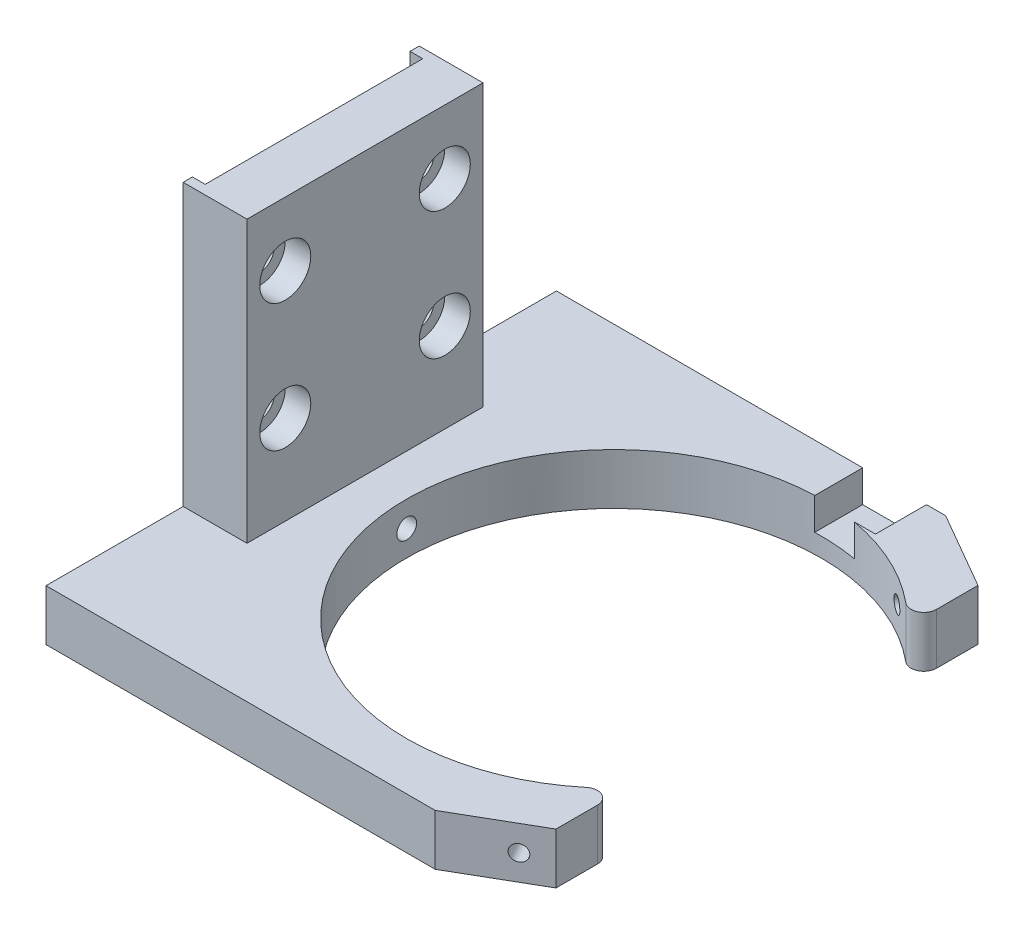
ISO-10303-21;
HEADER;
FILE_DESCRIPTION(('STEP AP214'),'2;1');
FILE_NAME('part.step','',(''),(''),'','','');
FILE_SCHEMA(('AUTOMOTIVE_DESIGN { 1 0 10303 214 1 1 1 1 }'));
ENDSEC;
DATA;
#1=APPLICATION_CONTEXT('core data for automotive mechanical design processes');
#2=APPLICATION_PROTOCOL_DEFINITION('international standard','automotive_design',2000,#1);
#3=PRODUCT_CONTEXT('',#1,'mechanical');
#4=PRODUCT('Part','Part','',(#3));
#5=PRODUCT_RELATED_PRODUCT_CATEGORY('part','',(#4));
#6=PRODUCT_DEFINITION_FORMATION('','',#4);
#7=PRODUCT_DEFINITION_CONTEXT('part definition',#1,'design');
#8=PRODUCT_DEFINITION('design','',#6,#7);
#9=PRODUCT_DEFINITION_SHAPE('','',#8);
#10=(LENGTH_UNIT() NAMED_UNIT(*) SI_UNIT(.MILLI.,.METRE.));
#11=(NAMED_UNIT(*) PLANE_ANGLE_UNIT() SI_UNIT($,.RADIAN.));
#12=(NAMED_UNIT(*) SI_UNIT($,.STERADIAN.) SOLID_ANGLE_UNIT());
#13=UNCERTAINTY_MEASURE_WITH_UNIT(LENGTH_MEASURE(1.E-05),#10,'distance_accuracy_value','');
#14=(GEOMETRIC_REPRESENTATION_CONTEXT(3) GLOBAL_UNCERTAINTY_ASSIGNED_CONTEXT((#13)) GLOBAL_UNIT_ASSIGNED_CONTEXT((#10,
#11,#12)) REPRESENTATION_CONTEXT('',''));
#15=CARTESIAN_POINT('',(0.,0.,0.));
#16=DIRECTION('',(0.,0.,1.));
#17=DIRECTION('',(1.,0.,0.));
#18=AXIS2_PLACEMENT_3D('',#15,#16,#17);
#19=CARTESIAN_POINT('',(0.,8.,0.));
#20=DIRECTION('',(0.,1.,0.));
#21=DIRECTION('',(0.,0.,1.));
#22=AXIS2_PLACEMENT_3D('',#19,#20,#21);
#23=PLANE('',#22);
#24=DIRECTION('',(0.,0.,-1.));
#25=VECTOR('',#24,1.);
#26=CARTESIAN_POINT('',(8.99999999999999,8.,-40.));
#27=LINE('',#26,#25);
#28=CARTESIAN_POINT('',(8.99999999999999,8.,-32.));
#29=VERTEX_POINT('',#28);
#30=CARTESIAN_POINT('',(8.99999999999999,8.,-40.));
#31=VERTEX_POINT('',#30);
#32=EDGE_CURVE('E198',#29,#31,#27,.T.);
#33=ORIENTED_EDGE('',*,*,#32,.F.);
#34=DIRECTION('',(1.,0.,0.));
#35=VECTOR('',#34,1.);
#36=CARTESIAN_POINT('',(0.,8.,-32.));
#37=LINE('',#36,#35);
#38=CARTESIAN_POINT('',(5.67890834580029,8.,-32.));
#39=VERTEX_POINT('',#38);
#40=EDGE_CURVE('E11',#39,#29,#37,.T.);
#41=ORIENTED_EDGE('',*,*,#40,.F.);
#42=CARTESIAN_POINT('',(0.,8.,0.));
#43=DIRECTION('',(0.,-1.,0.));
#44=DIRECTION('',(0.,0.,1.));
#45=AXIS2_PLACEMENT_3D('',#42,#43,#44);
#46=CIRCLE('',#45,32.5);
#47=CARTESIAN_POINT('',(20.7246376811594,8.,-25.0347636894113));
#48=VERTEX_POINT('',#47);
#49=EDGE_CURVE('E60',#39,#48,#46,.T.);
#50=ORIENTED_EDGE('',*,*,#49,.T.);
#51=CARTESIAN_POINT('',(22.,8.,-26.5753645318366));
#52=DIRECTION('',(0.,1.,0.));
#53=DIRECTION('',(0.,0.,1.));
#54=AXIS2_PLACEMENT_3D('',#51,#52,#53);
#55=CIRCLE('',#54,2.);
#56=CARTESIAN_POINT('',(24.,8.,-26.5753645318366));
#57=VERTEX_POINT('',#56);
#58=EDGE_CURVE('E45',#48,#57,#55,.T.);
#59=ORIENTED_EDGE('',*,*,#58,.T.);
#60=DIRECTION('',(0.,0.,-1.));
#61=VECTOR('',#60,1.);
#62=CARTESIAN_POINT('',(24.,8.,0.));
#63=LINE('',#62,#61);
#64=CARTESIAN_POINT('',(24.,8.,-33.0717967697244));
#65=VERTEX_POINT('',#64);
#66=EDGE_CURVE('E401',#57,#65,#63,.T.);
#67=ORIENTED_EDGE('',*,*,#66,.T.);
#68=DIRECTION('',(-0.866025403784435,0.,-0.500000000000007));
#69=VECTOR('',#68,1.);
#70=CARTESIAN_POINT('',(20.320508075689,8.,-35.1961524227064));
#71=LINE('',#70,#69);
#72=CARTESIAN_POINT('',(12.,8.,-40.));
#73=VERTEX_POINT('',#72);
#74=EDGE_CURVE('E397',#65,#73,#71,.T.);
#75=ORIENTED_EDGE('',*,*,#74,.T.);
#76=DIRECTION('',(-1.,0.,0.));
#77=VECTOR('',#76,1.);
#78=CARTESIAN_POINT('',(26.,8.,-40.));
#79=LINE('',#78,#77);
#80=EDGE_CURVE('E333',#73,#31,#79,.T.);
#81=ORIENTED_EDGE('',*,*,#80,.T.);
#82=EDGE_LOOP('',(#33,#41,#50,#59,#67,#75,#81));
#83=FACE_BOUND('',#82,.T.);
#84=ADVANCED_FACE('F36',(#83),#23,.T.);
#85=CARTESIAN_POINT('',(0.,8.,0.));
#86=DIRECTION('',(0.,-1.,0.));
#87=DIRECTION('',(0.,0.,-1.));
#88=AXIS2_PLACEMENT_3D('',#85,#86,#87);
#89=CYLINDRICAL_SURFACE('',#88,32.5);
#90=CARTESIAN_POINT('',(15.1554445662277,4.,-28.75));
#91=CARTESIAN_POINT('',(15.1554474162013,4.07018518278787,-28.7499987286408));
#92=CARTESIAN_POINT('',(15.1606959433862,4.14042059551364,-28.7472336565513));
#93=CARTESIAN_POINT('',(15.1815501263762,4.27895518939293,-28.7362257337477));
#94=CARTESIAN_POINT('',(15.1971680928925,4.34725196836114,-28.72797637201));
#95=CARTESIAN_POINT('',(15.2382861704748,4.4798823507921,-28.7061870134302));
#96=CARTESIAN_POINT('',(15.2637813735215,4.54421790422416,-28.6926496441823));
#97=CARTESIAN_POINT('',(15.3238798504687,4.66711540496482,-28.6605976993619));
#98=CARTESIAN_POINT('',(15.3584809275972,4.72567874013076,-28.6420843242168));
#99=CARTESIAN_POINT('',(15.4357814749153,4.83542572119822,-28.6004995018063));
#100=CARTESIAN_POINT('',(15.4784855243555,4.88660516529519,-28.5774254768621));
#101=CARTESIAN_POINT('',(15.5707132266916,4.98009595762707,-28.5272788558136));
#102=CARTESIAN_POINT('',(15.6202371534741,5.02240694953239,-28.5002060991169));
#103=CARTESIAN_POINT('',(15.7246600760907,5.09696912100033,-28.4427251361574));
#104=CARTESIAN_POINT('',(15.7795606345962,5.12921736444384,-28.4123159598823));
#105=CARTESIAN_POINT('',(15.8931198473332,5.1827196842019,-28.3489499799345));
#106=CARTESIAN_POINT('',(15.9517784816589,5.20397381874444,-28.3159931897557));
#107=CARTESIAN_POINT('',(16.0711245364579,5.23487441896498,-28.2484274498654));
#108=CARTESIAN_POINT('',(16.1318109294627,5.24452667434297,-28.21381933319));
#109=CARTESIAN_POINT('',(16.2535001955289,5.25196737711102,-28.1438919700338));
#110=CARTESIAN_POINT('',(16.3145030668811,5.24975588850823,-28.1085727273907));
#111=CARTESIAN_POINT('',(16.4350633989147,5.23353672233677,-28.0382517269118));
#112=CARTESIAN_POINT('',(16.4946216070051,5.2195352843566,-28.0032498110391));
#113=CARTESIAN_POINT('',(16.6106590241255,5.18014333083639,-27.9345763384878));
#114=CARTESIAN_POINT('',(16.6671382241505,5.15475278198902,-27.9009047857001));
#115=CARTESIAN_POINT('',(16.7754704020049,5.09329620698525,-27.8359046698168));
#116=CARTESIAN_POINT('',(16.8273221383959,5.05722732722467,-27.8045767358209));
#117=CARTESIAN_POINT('',(16.9249651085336,4.97544005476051,-27.7452486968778));
#118=CARTESIAN_POINT('',(16.9707563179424,4.92972162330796,-27.7172486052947));
#119=CARTESIAN_POINT('',(17.0550663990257,4.82989772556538,-27.665450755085));
#120=CARTESIAN_POINT('',(17.0935805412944,4.77578684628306,-27.6416557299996));
#121=CARTESIAN_POINT('',(17.1622641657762,4.66073312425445,-27.5990638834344));
#122=CARTESIAN_POINT('',(17.1924336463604,4.59979028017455,-27.5802670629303));
#123=CARTESIAN_POINT('',(17.2436214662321,4.47279941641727,-27.5482927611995));
#124=CARTESIAN_POINT('',(17.2646396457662,4.40675130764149,-27.5351153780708));
#125=CARTESIAN_POINT('',(17.2969633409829,4.27142620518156,-27.5148219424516));
#126=CARTESIAN_POINT('',(17.3082688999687,4.20214922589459,-27.5077058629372));
#127=CARTESIAN_POINT('',(17.3208622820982,4.06238044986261,-27.4997779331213));
#128=CARTESIAN_POINT('',(17.3221565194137,3.99188945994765,-27.4989620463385));
#129=CARTESIAN_POINT('',(17.314709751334,3.85165187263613,-27.5036514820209));
#130=CARTESIAN_POINT('',(17.305968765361,3.78190527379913,-27.509156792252));
#131=CARTESIAN_POINT('',(17.2786882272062,3.64515750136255,-27.5262999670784));
#132=CARTESIAN_POINT('',(17.2601516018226,3.57815551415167,-27.5379359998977));
#133=CARTESIAN_POINT('',(17.2137748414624,3.44877389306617,-27.5669494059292));
#134=CARTESIAN_POINT('',(17.1859346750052,3.38639427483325,-27.5843267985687));
#135=CARTESIAN_POINT('',(17.1216769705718,3.26799325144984,-27.6242575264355));
#136=CARTESIAN_POINT('',(17.0852550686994,3.21197510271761,-27.6468134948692));
#137=CARTESIAN_POINT('',(17.0048182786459,3.10791989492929,-27.6963604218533));
#138=CARTESIAN_POINT('',(16.9608033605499,3.05988286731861,-27.7233513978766));
#139=CARTESIAN_POINT('',(16.8663445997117,2.97312815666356,-27.780919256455));
#140=CARTESIAN_POINT('',(16.8158974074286,2.93441535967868,-27.8114980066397));
#141=CARTESIAN_POINT('',(16.7099695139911,2.86744142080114,-27.8752710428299));
#142=CARTESIAN_POINT('',(16.6544888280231,2.8391802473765,-27.9084653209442));
#143=CARTESIAN_POINT('',(16.5400421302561,2.79392035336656,-27.9764442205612));
#144=CARTESIAN_POINT('',(16.48107709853,2.77691848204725,-28.0112283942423));
#145=CARTESIAN_POINT('',(16.3612955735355,2.75464948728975,-28.0813607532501));
#146=CARTESIAN_POINT('',(16.300479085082,2.74938233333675,-28.1167089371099));
#147=CARTESIAN_POINT('',(16.1787545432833,2.75073264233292,-28.1869266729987));
#148=CARTESIAN_POINT('',(16.117846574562,2.75734242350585,-28.2217965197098));
#149=CARTESIAN_POINT('',(15.9976396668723,2.78224313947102,-28.2901096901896));
#150=CARTESIAN_POINT('',(15.9383407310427,2.80053409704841,-28.3235530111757));
#151=CARTESIAN_POINT('',(15.8230621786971,2.84827660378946,-28.3881149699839));
#152=CARTESIAN_POINT('',(15.7670826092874,2.87772831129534,-28.4192335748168));
#153=CARTESIAN_POINT('',(15.6600750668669,2.94695444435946,-28.4783389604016));
#154=CARTESIAN_POINT('',(15.6090469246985,2.98672851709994,-28.5063258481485));
#155=CARTESIAN_POINT('',(15.5134118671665,3.07549596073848,-28.5584843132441));
#156=CARTESIAN_POINT('',(15.4688084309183,3.12449429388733,-28.5826538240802));
#157=CARTESIAN_POINT('',(15.387366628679,3.23032346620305,-28.6265802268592));
#158=CARTESIAN_POINT('',(15.3505301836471,3.28715623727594,-28.6463360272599));
#159=CARTESIAN_POINT('',(15.2857129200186,3.40707132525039,-28.6809751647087));
#160=CARTESIAN_POINT('',(15.2577388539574,3.47015835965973,-28.6958547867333));
#161=CARTESIAN_POINT('',(15.2115525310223,3.60070955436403,-28.7203648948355));
#162=CARTESIAN_POINT('',(15.1933286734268,3.66816840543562,-28.7300016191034));
#163=CARTESIAN_POINT('',(15.1720049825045,3.78004240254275,-28.7412655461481));
#164=CARTESIAN_POINT('',(15.1658030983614,3.82373192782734,-28.7445375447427));
#165=CARTESIAN_POINT('',(15.1575219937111,3.91160765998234,-28.7489051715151));
#166=CARTESIAN_POINT('',(15.155442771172,3.95579386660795,-28.7500008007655));
#167=CARTESIAN_POINT('',(15.1554445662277,4.,-28.75));
#168=B_SPLINE_CURVE_WITH_KNOTS('',3,(#90,#91,#92,#93,#94,#95,#96,#97,#98,#99,#100,#101,#102,
#103,#104,#105,#106,#107,#108,#109,#110,#111,#112,#113,#114,#115,#116,#117,#118,#119,#120,#121,
#122,#123,#124,#125,#126,#127,#128,#129,#130,#131,#132,#133,#134,#135,#136,#137,#138,#139,#140,
#141,#142,#143,#144,#145,#146,#147,#148,#149,#150,#151,#152,#153,#154,#155,#156,#157,#158,#159,
#160,#161,#162,#163,#164,#165,#166,#167),.UNSPECIFIED.,.T.,.F.,(4,2,2,2,2,2,2,2,2,2,2,2,2,2,2,2,
2,2,2,2,2,2,2,2,2,2,2,2,2,2,2,2,2,2,2,2,2,2,4),(0.,0.21039418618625,0.421038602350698,
0.631578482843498,0.842067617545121,1.05267606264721,1.26329296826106,1.47397127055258,
1.68464845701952,1.89522046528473,2.10579133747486,2.31625083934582,2.52671095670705,
2.73722736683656,2.94774462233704,3.15839822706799,3.36905187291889,3.57970919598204,
3.79036557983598,4.0008869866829,4.211407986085,4.42186612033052,4.63232496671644,
4.84289106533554,5.05345799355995,5.26413502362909,5.47481141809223,5.68542883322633,
5.89604570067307,6.10652639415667,6.31700749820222,6.52749158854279,6.73796848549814,
6.94855893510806,7.15920140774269,7.37000399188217,7.58055520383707,7.71307203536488,
7.84558880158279),.UNSPECIFIED.);
#169=CARTESIAN_POINT('',(15.1554445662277,4.,-28.75));
#170=VERTEX_POINT('',#169);
#171=EDGE_CURVE('E282',#170,#170,#168,.T.);
#172=ORIENTED_EDGE('',*,*,#171,.T.);
#173=EDGE_LOOP('',(#172));
#174=FACE_BOUND('',#173,.T.);
#175=CARTESIAN_POINT('',(-32.4630174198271,4.,1.54999999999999));
#176=CARTESIAN_POINT('',(-32.4630179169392,4.08701104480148,1.54999615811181));
#177=CARTESIAN_POINT('',(-32.4633710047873,4.17408392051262,1.5426486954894));
#178=CARTESIAN_POINT('',(-32.4647454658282,4.34582799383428,1.513442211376));
#179=CARTESIAN_POINT('',(-32.465767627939,4.43049623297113,1.49156605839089));
#180=CARTESIAN_POINT('',(-32.4683641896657,4.59491827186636,1.43392964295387));
#181=CARTESIAN_POINT('',(-32.4699383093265,4.67467453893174,1.39817641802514));
#182=CARTESIAN_POINT('',(-32.4734610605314,4.8270317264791,1.31381146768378));
#183=CARTESIAN_POINT('',(-32.4754096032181,4.89963433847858,1.26520279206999));
#184=CARTESIAN_POINT('',(-32.4794637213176,5.03571281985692,1.15645601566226));
#185=CARTESIAN_POINT('',(-32.4815694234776,5.09918119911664,1.09630854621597));
#186=CARTESIAN_POINT('',(-32.4856993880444,5.21512578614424,0.966210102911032));
#187=CARTESIAN_POINT('',(-32.4877236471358,5.26760154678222,0.896258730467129));
#188=CARTESIAN_POINT('',(-32.4914635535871,5.36009121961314,0.748499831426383));
#189=CARTESIAN_POINT('',(-32.493179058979,5.40009940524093,0.670688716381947));
#190=CARTESIAN_POINT('',(-32.4961068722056,5.46648145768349,0.509444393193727));
#191=CARTESIAN_POINT('',(-32.4973191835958,5.49285542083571,0.42601122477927));
#192=CARTESIAN_POINT('',(-32.4991031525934,5.5312008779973,0.255959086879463));
#193=CARTESIAN_POINT('',(-32.4996753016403,5.54318342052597,0.169342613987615));
#194=CARTESIAN_POINT('',(-32.5001161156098,5.55243998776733,-0.00467411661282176));
#195=CARTESIAN_POINT('',(-32.4999847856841,5.54971412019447,-0.0920743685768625));
#196=CARTESIAN_POINT('',(-32.4990338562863,5.52964042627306,-0.265102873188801));
#197=CARTESIAN_POINT('',(-32.4982148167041,5.51230449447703,-0.350732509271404));
#198=CARTESIAN_POINT('',(-32.4959813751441,5.46352121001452,-0.517864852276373));
#199=CARTESIAN_POINT('',(-32.4945669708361,5.4320738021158,-0.599367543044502));
#200=CARTESIAN_POINT('',(-32.4913011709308,5.35594666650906,-0.755970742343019));
#201=CARTESIAN_POINT('',(-32.4894495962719,5.31126151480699,-0.831068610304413));
#202=CARTESIAN_POINT('',(-32.4855179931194,5.20993130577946,-0.972701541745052));
#203=CARTESIAN_POINT('',(-32.4834379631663,5.15328617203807,-1.03923655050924));
#204=CARTESIAN_POINT('',(-32.4792812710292,5.02957669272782,-1.16192444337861));
#205=CARTESIAN_POINT('',(-32.4772046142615,4.9625020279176,-1.21806692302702));
#206=CARTESIAN_POINT('',(-32.4732908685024,4.81987375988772,-1.3182959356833));
#207=CARTESIAN_POINT('',(-32.4714537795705,4.74432015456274,-1.36238246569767));
#208=CARTESIAN_POINT('',(-32.4682264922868,4.58687247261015,-1.43724718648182));
#209=CARTESIAN_POINT('',(-32.466836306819,4.50497821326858,-1.46802499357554));
#210=CARTESIAN_POINT('',(-32.4646600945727,4.33717670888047,-1.51539168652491));
#211=CARTESIAN_POINT('',(-32.4638740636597,4.25126949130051,-1.53198066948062));
#212=CARTESIAN_POINT('',(-32.4629955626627,4.07797127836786,-1.55048596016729));
#213=CARTESIAN_POINT('',(-32.4629024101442,3.99058182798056,-1.5524167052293));
#214=CARTESIAN_POINT('',(-32.4634183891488,3.81672016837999,-1.54158838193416));
#215=CARTESIAN_POINT('',(-32.4640275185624,3.73024795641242,-1.52882935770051));
#216=CARTESIAN_POINT('',(-32.4658787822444,3.56071591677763,-1.48899564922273));
#217=CARTESIAN_POINT('',(-32.4671206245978,3.47765453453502,-1.46192756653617));
#218=CARTESIAN_POINT('',(-32.4700970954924,3.31725409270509,-1.39425078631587));
#219=CARTESIAN_POINT('',(-32.4718317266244,3.23991506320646,-1.35364201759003));
#220=CARTESIAN_POINT('',(-32.4755999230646,3.09308826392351,-1.25999952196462));
#221=CARTESIAN_POINT('',(-32.4776337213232,3.02360668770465,-1.20695609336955));
#222=CARTESIAN_POINT('',(-32.4817701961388,2.89452941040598,-1.08996416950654));
#223=CARTESIAN_POINT('',(-32.4838728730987,2.83493376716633,-1.02601561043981));
#224=CARTESIAN_POINT('',(-32.4879121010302,2.72727158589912,-0.888966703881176));
#225=CARTESIAN_POINT('',(-32.489848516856,2.67921437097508,-0.815859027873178));
#226=CARTESIAN_POINT('',(-32.4933350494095,2.59605694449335,-0.662604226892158));
#227=CARTESIAN_POINT('',(-32.4948851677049,2.56095668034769,-0.582457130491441));
#228=CARTESIAN_POINT('',(-32.4974237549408,2.50472583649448,-0.417433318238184));
#229=CARTESIAN_POINT('',(-32.4984124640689,2.48358928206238,-0.332558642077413));
#230=CARTESIAN_POINT('',(-32.4997177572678,2.45586627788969,-0.160460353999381));
#231=CARTESIAN_POINT('',(-32.5000343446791,2.44927975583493,-0.0732367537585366));
#232=CARTESIAN_POINT('',(-32.4999597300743,2.4508444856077,0.100990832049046));
#233=CARTESIAN_POINT('',(-32.4995692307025,2.45898110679,0.187994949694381));
#234=CARTESIAN_POINT('',(-32.4981257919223,2.48973092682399,0.35940047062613));
#235=CARTESIAN_POINT('',(-32.4970728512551,2.51234415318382,0.44380186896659));
#236=CARTESIAN_POINT('',(-32.4944230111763,2.57140235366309,0.607609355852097));
#237=CARTESIAN_POINT('',(-32.4928261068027,2.60784745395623,0.687015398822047));
#238=CARTESIAN_POINT('',(-32.4892679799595,2.69353217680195,0.838582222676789));
#239=CARTESIAN_POINT('',(-32.4873067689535,2.74277139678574,0.910743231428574));
#240=CARTESIAN_POINT('',(-32.4832385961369,2.85269849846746,1.0458443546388));
#241=CARTESIAN_POINT('',(-32.481131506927,2.91339646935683,1.10877625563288));
#242=CARTESIAN_POINT('',(-32.4770098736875,3.04451351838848,1.22357628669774));
#243=CARTESIAN_POINT('',(-32.4749953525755,3.11493498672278,1.27544168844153));
#244=CARTESIAN_POINT('',(-32.4712848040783,3.26355146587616,1.36665857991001));
#245=CARTESIAN_POINT('',(-32.4695890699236,3.34175353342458,1.40599857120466));
#246=CARTESIAN_POINT('',(-32.4667120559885,3.50360197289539,1.47094357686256));
#247=CARTESIAN_POINT('',(-32.4655301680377,3.58724177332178,1.49656483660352));
#248=CARTESIAN_POINT('',(-32.4641274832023,3.72616873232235,1.52661475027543));
#249=CARTESIAN_POINT('',(-32.4637130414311,3.78055575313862,1.53537304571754));
#250=CARTESIAN_POINT('',(-32.4631578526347,3.88995360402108,1.54706688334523));
#251=CARTESIAN_POINT('',(-32.4630171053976,3.94496443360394,1.55000243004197));
#252=CARTESIAN_POINT('',(-32.4630174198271,4.,1.54999999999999));
#253=B_SPLINE_CURVE_WITH_KNOTS('',3,(#175,#176,#177,#178,#179,#180,#181,#182,#183,#184,#185,
#186,#187,#188,#189,#190,#191,#192,#193,#194,#195,#196,#197,#198,#199,#200,#201,#202,#203,#204,
#205,#206,#207,#208,#209,#210,#211,#212,#213,#214,#215,#216,#217,#218,#219,#220,#221,#222,#223,
#224,#225,#226,#227,#228,#229,#230,#231,#232,#233,#234,#235,#236,#237,#238,#239,#240,#241,#242,
#243,#244,#245,#246,#247,#248,#249,#250,#251,#252),.UNSPECIFIED.,.T.,.F.,(4,2,2,2,2,2,2,2,2,2,2,
2,2,2,2,2,2,2,2,2,2,2,2,2,2,2,2,2,2,2,2,2,2,2,2,2,2,2,4),(0.,0.260832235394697,
0.521972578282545,0.782980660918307,1.04392687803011,1.3050858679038,1.56625547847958,
1.82754487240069,2.08883242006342,2.34991924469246,2.61100415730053,2.87187671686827,
3.13275029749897,3.39373091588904,3.65471320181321,3.91595537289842,4.17719760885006,
4.43844737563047,4.69969535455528,4.96068598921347,5.22167583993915,5.48254538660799,
5.74341630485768,6.00449143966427,6.26556810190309,6.52685501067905,6.7881408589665,
7.04931483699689,7.31048751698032,7.57140080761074,7.83231459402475,8.09323076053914,
8.35413871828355,8.61527748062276,8.87648054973,9.13792271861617,9.39905460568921,
9.56403436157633,9.72901398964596),.UNSPECIFIED.);
#254=CARTESIAN_POINT('',(-32.4630174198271,4.,1.54999999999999));
#255=VERTEX_POINT('',#254);
#256=EDGE_CURVE('E223',#255,#255,#253,.T.);
#257=ORIENTED_EDGE('',*,*,#256,.T.);
#258=EDGE_LOOP('',(#257));
#259=FACE_BOUND('',#258,.T.);
#260=ORIENTED_EDGE('',*,*,#49,.F.);
#261=DIRECTION('',(0.,-1.,0.));
#262=VECTOR('',#261,1.);
#263=CARTESIAN_POINT('',(5.67890834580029,8.,-32.));
#264=LINE('',#263,#262);
#265=CARTESIAN_POINT('',(5.67890834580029,3.,-32.));
#266=VERTEX_POINT('',#265);
#267=EDGE_CURVE('E231',#39,#266,#264,.T.);
#268=ORIENTED_EDGE('',*,*,#267,.T.);
#269=CARTESIAN_POINT('',(0.,3.,0.));
#270=DIRECTION('',(0.,-1.,0.));
#271=DIRECTION('',(0.,0.,-1.));
#272=AXIS2_PLACEMENT_3D('',#269,#270,#271);
#273=CIRCLE('',#272,32.5);
#274=CARTESIAN_POINT('',(-1.00000000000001,3.,-32.4846117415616));
#275=VERTEX_POINT('',#274);
#276=EDGE_CURVE('E234',#266,#275,#273,.F.);
#277=ORIENTED_EDGE('',*,*,#276,.T.);
#278=DIRECTION('',(0.,-1.,0.));
#279=VECTOR('',#278,1.);
#280=CARTESIAN_POINT('',(-1.00000000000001,8.,-32.4846117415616));
#281=LINE('',#280,#279);
#282=CARTESIAN_POINT('',(-1.00000000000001,8.,-32.4846117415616));
#283=VERTEX_POINT('',#282);
#284=EDGE_CURVE('E227',#275,#283,#281,.F.);
#285=ORIENTED_EDGE('',*,*,#284,.T.);
#286=CARTESIAN_POINT('',(20.7246376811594,8.,25.0347636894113));
#287=VERTEX_POINT('',#286);
#288=EDGE_CURVE('E329',#287,#283,#46,.T.);
#289=ORIENTED_EDGE('',*,*,#288,.F.);
#290=DIRECTION('',(0.,-1.,0.));
#291=VECTOR('',#290,1.);
#292=CARTESIAN_POINT('',(20.7246376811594,8.,25.0347636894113));
#293=LINE('',#292,#291);
#294=CARTESIAN_POINT('',(20.7246376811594,0.,25.0347636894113));
#295=VERTEX_POINT('',#294);
#296=EDGE_CURVE('E355',#287,#295,#293,.T.);
#297=ORIENTED_EDGE('',*,*,#296,.T.);
#298=CARTESIAN_POINT('',(0.,0.,0.));
#299=DIRECTION('',(0.,-1.,0.));
#300=DIRECTION('',(0.,0.,1.));
#301=AXIS2_PLACEMENT_3D('',#298,#299,#300);
#302=CIRCLE('',#301,32.5);
#303=CARTESIAN_POINT('',(20.7246376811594,0.,-25.0347636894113));
#304=VERTEX_POINT('',#303);
#305=EDGE_CURVE('E345',#295,#304,#302,.T.);
#306=ORIENTED_EDGE('',*,*,#305,.T.);
#307=DIRECTION('',(0.,-1.,0.));
#308=VECTOR('',#307,1.);
#309=CARTESIAN_POINT('',(20.7246376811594,8.,-25.0347636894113));
#310=LINE('',#309,#308);
#311=EDGE_CURVE('E524',#304,#48,#310,.F.);
#312=ORIENTED_EDGE('',*,*,#311,.T.);
#313=EDGE_LOOP('',(#260,#268,#277,#285,#289,#297,#306,#312));
#314=FACE_BOUND('',#313,.T.);
#315=CARTESIAN_POINT('',(17.320508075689,4.,27.4999999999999));
#316=CARTESIAN_POINT('',(17.3205055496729,4.07018518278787,27.5000018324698));
#317=CARTESIAN_POINT('',(17.3154866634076,4.14042059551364,27.5031646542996));
#318=CARTESIAN_POINT('',(17.2955264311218,4.27895518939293,27.5157209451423));
#319=CARTESIAN_POINT('',(17.2805732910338,4.34725196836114,27.525121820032));
#320=CARTESIAN_POINT('',(17.2411441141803,4.4798823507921,27.5498364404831));
#321=CARTESIAN_POINT('',(17.2166728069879,4.54421790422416,27.5651472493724));
#322=CARTESIAN_POINT('',(17.1588657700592,4.66711540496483,27.6011680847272));
#323=CARTESIAN_POINT('',(17.1255321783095,4.72567874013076,27.6218768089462));
#324=CARTESIAN_POINT('',(17.0508683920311,4.83542572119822,27.6680286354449));
#325=CARTESIAN_POINT('',(17.0095336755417,4.88660516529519,27.6934744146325));
#326=CARTESIAN_POINT('',(16.9199915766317,4.98009595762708,27.748272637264));
#327=CARTESIAN_POINT('',(16.8717839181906,5.02240694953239,27.7776252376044));
#328=CARTESIAN_POINT('',(16.7697924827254,5.09696912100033,27.839317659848));
#329=CARTESIAN_POINT('',(16.7160070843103,5.12921736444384,27.8716583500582));
#330=CARTESIAN_POINT('',(16.6043509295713,5.1827196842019,27.9383205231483));
#331=CARTESIAN_POINT('',(16.5464801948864,5.20397381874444,27.9726419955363));
#332=CARTESIAN_POINT('',(16.4282935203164,5.23487441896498,28.0422158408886));
#333=CARTESIAN_POINT('',(16.367978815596,5.24452667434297,28.077467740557));
#334=CARTESIAN_POINT('',(16.24657530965,5.25196737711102,28.1478900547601));
#335=CARTESIAN_POINT('',(16.1854865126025,5.24975588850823,28.1830604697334));
#336=CARTESIAN_POINT('',(16.0643065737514,5.23353672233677,28.2523082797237));
#337=CARTESIAN_POINT('',(16.0042149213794,5.2195352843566,28.2863862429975));
#338=CARTESIAN_POINT('',(15.8867232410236,5.18014333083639,28.3525408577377));
#339=CARTESIAN_POINT('',(15.8293232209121,5.15475278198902,28.3846175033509));
#340=CARTESIAN_POINT('',(15.7188653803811,5.09329620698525,28.4459358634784));
#341=CARTESIAN_POINT('',(15.665808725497,5.05722732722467,28.4751768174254));
#342=CARTESIAN_POINT('',(15.5656076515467,4.97544005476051,28.5300740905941));
#343=CARTESIAN_POINT('',(15.5184632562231,4.92972162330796,28.5557303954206));
#344=CARTESIAN_POINT('',(15.4314499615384,4.82989772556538,28.6028461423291));
#345=CARTESIAN_POINT('',(15.3915857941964,4.77578684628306,28.624302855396));
#346=CARTESIAN_POINT('',(15.320358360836,4.66073312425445,28.6624886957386));
#347=CARTESIAN_POINT('',(15.288995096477,4.59979028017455,28.6792178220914));
#348=CARTESIAN_POINT('',(15.235710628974,4.47279941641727,28.7075606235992));
#349=CARTESIAN_POINT('',(15.2137895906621,4.40675130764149,28.7191742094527));
#350=CARTESIAN_POINT('',(15.1800531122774,4.27142620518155,28.737020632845));
#351=CARTESIAN_POINT('',(15.1682376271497,4.20214922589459,28.7432534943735));
#352=CARTESIAN_POINT('',(15.1550751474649,4.06238044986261,28.7501957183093));
#353=CARTESIAN_POINT('',(15.1537214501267,3.99188945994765,28.7509086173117));
#354=CARTESIAN_POINT('',(15.1615060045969,3.85165187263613,28.7468042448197));
#355=CARTESIAN_POINT('',(15.1706442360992,3.78190527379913,28.7419869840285));
#356=CARTESIAN_POINT('',(15.1991309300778,3.64515750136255,28.7269329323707));
#357=CARTESIAN_POINT('',(15.2184763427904,3.57815551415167,28.7166977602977));
#358=CARTESIAN_POINT('',(15.2667910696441,3.44877389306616,28.6910410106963));
#359=CARTESIAN_POINT('',(15.2957604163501,3.38639427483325,28.6756194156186));
#360=CARTESIAN_POINT('',(15.362470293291,3.26799325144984,28.6399359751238));
#361=CARTESIAN_POINT('',(15.4002152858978,3.21197510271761,28.619671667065));
#362=CARTESIAN_POINT('',(15.4833425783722,3.10791989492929,28.5747848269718));
#363=CARTESIAN_POINT('',(15.5287249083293,3.0598828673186,28.5501622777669));
#364=CARTESIAN_POINT('',(15.6258095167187,2.97312815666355,28.4971425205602));
#365=CARTESIAN_POINT('',(15.6775150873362,2.93441535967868,28.4687433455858));
#366=CARTESIAN_POINT('',(15.7857081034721,2.86744142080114,28.4088936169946));
#367=CARTESIAN_POINT('',(15.8421955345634,2.8391802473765,28.3774430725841));
#368=CARTESIAN_POINT('',(15.9582903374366,2.79392035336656,28.3123187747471));
#369=CARTESIAN_POINT('',(16.0178968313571,2.77691848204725,28.2786456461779));
#370=CARTESIAN_POINT('',(16.1385239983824,2.75464948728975,28.2099779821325));
#371=CARTESIAN_POINT('',(16.1995446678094,2.74938233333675,28.1749834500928));
#372=CARTESIAN_POINT('',(16.3212172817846,2.75073264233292,28.1046757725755));
#373=CARTESIAN_POINT('',(16.3818694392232,2.75734242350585,28.0693628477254));
#374=CARTESIAN_POINT('',(16.5011338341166,2.78224313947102,27.9994171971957));
#375=CARTESIAN_POINT('',(16.5597460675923,2.80053409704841,27.9647844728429));
#376=CARTESIAN_POINT('',(16.6732976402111,2.84827660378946,27.8972312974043));
#377=CARTESIAN_POINT('',(16.7282369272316,2.87772831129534,27.864310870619));
#378=CARTESIAN_POINT('',(16.8329274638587,2.94695444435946,27.8011923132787));
#379=CARTESIAN_POINT('',(16.8826788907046,2.98672851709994,27.7709940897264));
#380=CARTESIAN_POINT('',(16.9756669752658,3.07549596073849,27.714250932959));
#381=CARTESIAN_POINT('',(17.018900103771,3.12449429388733,27.68770797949));
#382=CARTESIAN_POINT('',(17.0976623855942,3.23032346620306,27.6391405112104));
#383=CARTESIAN_POINT('',(17.1331896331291,3.28715623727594,27.6171171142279));
#384=CARTESIAN_POINT('',(17.1955966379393,3.40707132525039,27.5783032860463));
#385=CARTESIAN_POINT('',(17.2224698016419,3.47015835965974,27.5615168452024));
#386=CARTESIAN_POINT('',(17.2667893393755,3.60070955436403,27.5337733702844));
#387=CARTESIAN_POINT('',(17.2842469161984,3.66816840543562,27.5228094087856));
#388=CARTESIAN_POINT('',(17.3046636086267,3.78004240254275,27.5099745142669));
#389=CARTESIAN_POINT('',(17.3105981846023,3.82373192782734,27.5062395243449));
#390=CARTESIAN_POINT('',(17.3185212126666,3.91160765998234,27.5012516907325));
#391=CARTESIAN_POINT('',(17.3205096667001,3.95579386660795,27.4999988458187));
#392=CARTESIAN_POINT('',(17.320508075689,4.,27.4999999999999));
#393=B_SPLINE_CURVE_WITH_KNOTS('',3,(#315,#316,#317,#318,#319,#320,#321,#322,#323,#324,#325,
#326,#327,#328,#329,#330,#331,#332,#333,#334,#335,#336,#337,#338,#339,#340,#341,#342,#343,#344,
#345,#346,#347,#348,#349,#350,#351,#352,#353,#354,#355,#356,#357,#358,#359,#360,#361,#362,#363,
#364,#365,#366,#367,#368,#369,#370,#371,#372,#373,#374,#375,#376,#377,#378,#379,#380,#381,#382,
#383,#384,#385,#386,#387,#388,#389,#390,#391,#392),.UNSPECIFIED.,.T.,.F.,(4,2,2,2,2,2,2,2,2,2,2,
2,2,2,2,2,2,2,2,2,2,2,2,2,2,2,2,2,2,2,2,2,2,2,2,2,2,2,4),(0.,0.21039418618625,0.421038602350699,
0.631578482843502,0.842067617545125,1.05267606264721,1.26329296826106,1.47397127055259,
1.68464845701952,1.89522046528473,2.10579133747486,2.31625083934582,2.52671095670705,
2.73722736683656,2.94774462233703,3.15839822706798,3.36905187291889,3.57970919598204,
3.79036557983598,4.0008869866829,4.211407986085,4.42186612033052,4.63232496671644,
4.84289106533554,5.05345799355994,5.26413502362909,5.47481141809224,5.68542883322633,
5.89604570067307,6.10652639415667,6.31700749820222,6.52749158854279,6.73796848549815,
6.94855893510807,7.15920140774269,7.37000399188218,7.58055520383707,7.71307203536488,
7.84558880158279),.UNSPECIFIED.);
#394=CARTESIAN_POINT('',(17.320508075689,4.,27.4999999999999));
#395=VERTEX_POINT('',#394);
#396=EDGE_CURVE('E240',#395,#395,#393,.T.);
#397=ORIENTED_EDGE('',*,*,#396,.T.);
#398=EDGE_LOOP('',(#397));
#399=FACE_BOUND('',#398,.T.);
#400=ADVANCED_FACE('F305',(#174,#259,#314,#399),#89,.F.);
#401=CARTESIAN_POINT('',(26.,8.,-40.));
#402=DIRECTION('',(0.,0.,1.));
#403=DIRECTION('',(1.,0.,0.));
#404=AXIS2_PLACEMENT_3D('',#401,#402,#403);
#405=PLANE('',#404);
#406=DIRECTION('',(-1.,0.,0.));
#407=VECTOR('',#406,1.);
#408=CARTESIAN_POINT('',(8.99999999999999,3.,-40.));
#409=LINE('',#408,#407);
#410=CARTESIAN_POINT('',(8.99999999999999,3.,-40.));
#411=VERTEX_POINT('',#410);
#412=CARTESIAN_POINT('',(-1.00000000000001,3.,-40.));
#413=VERTEX_POINT('',#412);
#414=EDGE_CURVE('E209',#411,#413,#409,.T.);
#415=ORIENTED_EDGE('',*,*,#414,.F.);
#416=DIRECTION('',(0.,1.,0.));
#417=VECTOR('',#416,1.);
#418=CARTESIAN_POINT('',(8.99999999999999,3.,-40.));
#419=LINE('',#418,#417);
#420=EDGE_CURVE('E192',#411,#31,#419,.T.);
#421=ORIENTED_EDGE('',*,*,#420,.T.);
#422=ORIENTED_EDGE('',*,*,#80,.F.);
#423=DIRECTION('',(0.,-1.,0.));
#424=VECTOR('',#423,1.);
#425=CARTESIAN_POINT('',(12.,10.,-40.));
#426=LINE('',#425,#424);
#427=CARTESIAN_POINT('',(12.,0.,-40.));
#428=VERTEX_POINT('',#427);
#429=EDGE_CURVE('E537',#73,#428,#426,.T.);
#430=ORIENTED_EDGE('',*,*,#429,.T.);
#431=DIRECTION('',(-1.,0.,0.));
#432=VECTOR('',#431,1.);
#433=CARTESIAN_POINT('',(26.,0.,-40.));
#434=LINE('',#433,#432);
#435=CARTESIAN_POINT('',(-49.,0.,-40.));
#436=VERTEX_POINT('',#435);
#437=EDGE_CURVE('E348',#428,#436,#434,.T.);
#438=ORIENTED_EDGE('',*,*,#437,.T.);
#439=DIRECTION('',(0.,-1.,0.));
#440=VECTOR('',#439,1.);
#441=CARTESIAN_POINT('',(-49.,8.,-40.));
#442=LINE('',#441,#440);
#443=CARTESIAN_POINT('',(-49.,8.,-40.));
#444=VERTEX_POINT('',#443);
#445=EDGE_CURVE('E331',#444,#436,#442,.T.);
#446=ORIENTED_EDGE('',*,*,#445,.F.);
#447=CARTESIAN_POINT('',(-1.00000000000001,8.,-40.));
#448=VERTEX_POINT('',#447);
#449=EDGE_CURVE('E326',#448,#444,#79,.T.);
#450=ORIENTED_EDGE('',*,*,#449,.F.);
#451=DIRECTION('',(0.,1.,0.));
#452=VECTOR('',#451,1.);
#453=CARTESIAN_POINT('',(-1.00000000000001,3.,-40.));
#454=LINE('',#453,#452);
#455=EDGE_CURVE('E52',#413,#448,#454,.T.);
#456=ORIENTED_EDGE('',*,*,#455,.F.);
#457=EDGE_LOOP('',(#415,#421,#422,#430,#438,#446,#450,#456));
#458=FACE_BOUND('',#457,.T.);
#459=ADVANCED_FACE('F214',(#458),#405,.F.);
#460=DIRECTION('',(0.,0.,1.));
#461=VECTOR('',#460,1.);
#462=CARTESIAN_POINT('',(-1.00000000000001,8.,-40.));
#463=LINE('',#462,#461);
#464=EDGE_CURVE('E212',#448,#283,#463,.T.);
#465=ORIENTED_EDGE('',*,*,#464,.F.);
#466=ORIENTED_EDGE('',*,*,#449,.T.);
#467=DIRECTION('',(0.,0.,1.));
#468=VECTOR('',#467,1.);
#469=CARTESIAN_POINT('',(-49.,8.,-40.));
#470=LINE('',#469,#468);
#471=CARTESIAN_POINT('',(-49.,8.,-18.5));
#472=VERTEX_POINT('',#471);
#473=EDGE_CURVE('E356',#444,#472,#470,.T.);
#474=ORIENTED_EDGE('',*,*,#473,.T.);
#475=DIRECTION('',(-1.,0.,0.));
#476=VECTOR('',#475,1.);
#477=CARTESIAN_POINT('',(-49.,8.,-18.5));
#478=LINE('',#477,#476);
#479=CARTESIAN_POINT('',(-39.,8.,-18.5));
#480=VERTEX_POINT('',#479);
#481=EDGE_CURVE('E496',#480,#472,#478,.T.);
#482=ORIENTED_EDGE('',*,*,#481,.F.);
#483=DIRECTION('',(0.,0.,-1.));
#484=VECTOR('',#483,1.);
#485=CARTESIAN_POINT('',(-39.,8.,18.5));
#486=LINE('',#485,#484);
#487=CARTESIAN_POINT('',(-39.,8.,18.5));
#488=VERTEX_POINT('',#487);
#489=EDGE_CURVE('E493',#488,#480,#486,.T.);
#490=ORIENTED_EDGE('',*,*,#489,.F.);
#491=DIRECTION('',(1.,0.,0.));
#492=VECTOR('',#491,1.);
#493=CARTESIAN_POINT('',(-49.,8.,18.5));
#494=LINE('',#493,#492);
#495=CARTESIAN_POINT('',(-49.,8.,18.5));
#496=VERTEX_POINT('',#495);
#497=EDGE_CURVE('E481',#496,#488,#494,.T.);
#498=ORIENTED_EDGE('',*,*,#497,.F.);
#499=CARTESIAN_POINT('',(-49.,8.,40.));
#500=VERTEX_POINT('',#499);
#501=EDGE_CURVE('E350',#496,#500,#470,.T.);
#502=ORIENTED_EDGE('',*,*,#501,.T.);
#503=DIRECTION('',(1.,0.,0.));
#504=VECTOR('',#503,1.);
#505=CARTESIAN_POINT('',(-49.,8.,40.));
#506=LINE('',#505,#504);
#507=CARTESIAN_POINT('',(12.,8.,40.));
#508=VERTEX_POINT('',#507);
#509=EDGE_CURVE('E359',#500,#508,#506,.T.);
#510=ORIENTED_EDGE('',*,*,#509,.T.);
#511=DIRECTION('',(-0.866025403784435,0.,0.500000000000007));
#512=VECTOR('',#511,1.);
#513=CARTESIAN_POINT('',(20.320508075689,8.,35.1961524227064));
#514=LINE('',#513,#512);
#515=CARTESIAN_POINT('',(24.,8.,33.0717967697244));
#516=VERTEX_POINT('',#515);
#517=EDGE_CURVE('E370',#516,#508,#514,.T.);
#518=ORIENTED_EDGE('',*,*,#517,.F.);
#519=DIRECTION('',(0.,0.,1.));
#520=VECTOR('',#519,1.);
#521=CARTESIAN_POINT('',(24.,8.,0.));
#522=LINE('',#521,#520);
#523=CARTESIAN_POINT('',(24.,8.,26.5753645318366));
#524=VERTEX_POINT('',#523);
#525=EDGE_CURVE('E409',#524,#516,#522,.T.);
#526=ORIENTED_EDGE('',*,*,#525,.F.);
#527=CARTESIAN_POINT('',(22.,8.,26.5753645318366));
#528=DIRECTION('',(0.,1.,0.));
#529=DIRECTION('',(0.,0.,1.));
#530=AXIS2_PLACEMENT_3D('',#527,#528,#529);
#531=CIRCLE('',#530,2.);
#532=EDGE_CURVE('E517',#524,#287,#531,.T.);
#533=ORIENTED_EDGE('',*,*,#532,.T.);
#534=ORIENTED_EDGE('',*,*,#288,.T.);
#535=EDGE_LOOP('',(#465,#466,#474,#482,#490,#498,#502,#510,#518,#526,#533,#534));
#536=FACE_BOUND('',#535,.T.);
#537=ADVANCED_FACE('F307',(#536),#23,.T.);
#538=CARTESIAN_POINT('',(0.,0.,0.));
#539=DIRECTION('',(0.,1.,0.));
#540=DIRECTION('',(0.,0.,1.));
#541=AXIS2_PLACEMENT_3D('',#538,#539,#540);
#542=PLANE('',#541);
#543=DIRECTION('',(0.,0.,1.));
#544=VECTOR('',#543,1.);
#545=CARTESIAN_POINT('',(24.,0.,-33.0717967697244));
#546=LINE('',#545,#544);
#547=CARTESIAN_POINT('',(24.,0.,-33.0717967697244));
#548=VERTEX_POINT('',#547);
#549=CARTESIAN_POINT('',(24.,0.,-26.5753645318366));
#550=VERTEX_POINT('',#549);
#551=EDGE_CURVE('E247',#548,#550,#546,.T.);
#552=ORIENTED_EDGE('',*,*,#551,.T.);
#553=CARTESIAN_POINT('',(22.,0.,-26.5753645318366));
#554=DIRECTION('',(0.,1.,0.));
#555=DIRECTION('',(0.,0.,1.));
#556=AXIS2_PLACEMENT_3D('',#553,#554,#555);
#557=CIRCLE('',#556,2.);
#558=EDGE_CURVE('E522',#550,#304,#557,.F.);
#559=ORIENTED_EDGE('',*,*,#558,.T.);
#560=ORIENTED_EDGE('',*,*,#305,.F.);
#561=CARTESIAN_POINT('',(22.,0.,26.5753645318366));
#562=DIRECTION('',(0.,1.,0.));
#563=DIRECTION('',(0.,0.,1.));
#564=AXIS2_PLACEMENT_3D('',#561,#562,#563);
#565=CIRCLE('',#564,2.);
#566=CARTESIAN_POINT('',(24.,0.,26.5753645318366));
#567=VERTEX_POINT('',#566);
#568=EDGE_CURVE('E513',#295,#567,#565,.F.);
#569=ORIENTED_EDGE('',*,*,#568,.T.);
#570=DIRECTION('',(0.,0.,-1.));
#571=VECTOR('',#570,1.);
#572=CARTESIAN_POINT('',(24.,0.,33.0717967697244));
#573=LINE('',#572,#571);
#574=CARTESIAN_POINT('',(24.,0.,33.0717967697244));
#575=VERTEX_POINT('',#574);
#576=EDGE_CURVE('E394',#575,#567,#573,.T.);
#577=ORIENTED_EDGE('',*,*,#576,.F.);
#578=DIRECTION('',(0.866025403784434,0.,-0.500000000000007));
#579=VECTOR('',#578,1.);
#580=CARTESIAN_POINT('',(12.,0.,40.));
#581=LINE('',#580,#579);
#582=CARTESIAN_POINT('',(11.9999999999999,0.,40.));
#583=VERTEX_POINT('',#582);
#584=EDGE_CURVE('E392',#583,#575,#581,.T.);
#585=ORIENTED_EDGE('',*,*,#584,.F.);
#586=DIRECTION('',(1.,0.,0.));
#587=VECTOR('',#586,1.);
#588=CARTESIAN_POINT('',(-49.,0.,40.));
#589=LINE('',#588,#587);
#590=CARTESIAN_POINT('',(-49.,0.,40.));
#591=VERTEX_POINT('',#590);
#592=EDGE_CURVE('E341',#591,#583,#589,.T.);
#593=ORIENTED_EDGE('',*,*,#592,.F.);
#594=DIRECTION('',(0.,0.,1.));
#595=VECTOR('',#594,1.);
#596=CARTESIAN_POINT('',(-49.,0.,-40.));
#597=LINE('',#596,#595);
#598=CARTESIAN_POINT('',(-49.,0.,17.05));
#599=VERTEX_POINT('',#598);
#600=EDGE_CURVE('E342',#599,#591,#597,.T.);
#601=ORIENTED_EDGE('',*,*,#600,.F.);
#602=DIRECTION('',(-1.,0.,0.));
#603=VECTOR('',#602,1.);
#604=CARTESIAN_POINT('',(-47.,0.,17.05));
#605=LINE('',#604,#603);
#606=CARTESIAN_POINT('',(-47.,0.,17.05));
#607=VERTEX_POINT('',#606);
#608=EDGE_CURVE('E432',#607,#599,#605,.T.);
#609=ORIENTED_EDGE('',*,*,#608,.F.);
#610=DIRECTION('',(0.,0.,1.));
#611=VECTOR('',#610,1.);
#612=CARTESIAN_POINT('',(-47.,0.,-17.05));
#613=LINE('',#612,#611);
#614=CARTESIAN_POINT('',(-47.,0.,-17.05));
#615=VERTEX_POINT('',#614);
#616=EDGE_CURVE('E415',#615,#607,#613,.T.);
#617=ORIENTED_EDGE('',*,*,#616,.F.);
#618=DIRECTION('',(-1.,0.,0.));
#619=VECTOR('',#618,1.);
#620=CARTESIAN_POINT('',(-47.,0.,-17.05));
#621=LINE('',#620,#619);
#622=CARTESIAN_POINT('',(-49.,0.,-17.05));
#623=VERTEX_POINT('',#622);
#624=EDGE_CURVE('E423',#615,#623,#621,.T.);
#625=ORIENTED_EDGE('',*,*,#624,.T.);
#626=EDGE_CURVE('E338',#436,#623,#597,.T.);
#627=ORIENTED_EDGE('',*,*,#626,.F.);
#628=ORIENTED_EDGE('',*,*,#437,.F.);
#629=DIRECTION('',(0.866025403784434,0.,0.500000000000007));
#630=VECTOR('',#629,1.);
#631=CARTESIAN_POINT('',(12.,0.,-40.));
#632=LINE('',#631,#630);
#633=EDGE_CURVE('E660',#428,#548,#632,.T.);
#634=ORIENTED_EDGE('',*,*,#633,.T.);
#635=EDGE_LOOP('',(#552,#559,#560,#569,#577,#585,#593,#601,#609,#617,#625,#627,#628,#634));
#636=FACE_BOUND('',#635,.T.);
#637=ADVANCED_FACE('F316',(#636),#542,.F.);
#638=CARTESIAN_POINT('',(-49.,8.,-40.));
#639=DIRECTION('',(1.,0.,0.));
#640=DIRECTION('',(0.,0.,-1.));
#641=AXIS2_PLACEMENT_3D('',#638,#639,#640);
#642=PLANE('',#641);
#643=ORIENTED_EDGE('',*,*,#626,.T.);
#644=DIRECTION('',(0.,-1.,0.));
#645=VECTOR('',#644,1.);
#646=CARTESIAN_POINT('',(-49.,0.,-17.05));
#647=LINE('',#646,#645);
#648=CARTESIAN_POINT('',(-49.,52.,-17.05));
#649=VERTEX_POINT('',#648);
#650=EDGE_CURVE('E411',#649,#623,#647,.T.);
#651=ORIENTED_EDGE('',*,*,#650,.F.);
#652=DIRECTION('',(0.,0.,1.));
#653=VECTOR('',#652,1.);
#654=CARTESIAN_POINT('',(-49.,52.,18.5));
#655=LINE('',#654,#653);
#656=CARTESIAN_POINT('',(-49.,52.,-18.5));
#657=VERTEX_POINT('',#656);
#658=EDGE_CURVE('E482',#657,#649,#655,.T.);
#659=ORIENTED_EDGE('',*,*,#658,.F.);
#660=DIRECTION('',(0.,-1.,0.));
#661=VECTOR('',#660,1.);
#662=CARTESIAN_POINT('',(-49.,52.,-18.5));
#663=LINE('',#662,#661);
#664=EDGE_CURVE('E492',#657,#472,#663,.T.);
#665=ORIENTED_EDGE('',*,*,#664,.T.);
#666=ORIENTED_EDGE('',*,*,#473,.F.);
#667=ORIENTED_EDGE('',*,*,#445,.T.);
#668=EDGE_LOOP('',(#643,#651,#659,#665,#666,#667));
#669=FACE_BOUND('',#668,.T.);
#670=ADVANCED_FACE('F322',(#669),#642,.F.);
#671=CARTESIAN_POINT('',(-49.,52.,17.05));
#672=VERTEX_POINT('',#671);
#673=CARTESIAN_POINT('',(-49.,52.,18.5));
#674=VERTEX_POINT('',#673);
#675=EDGE_CURVE('E486',#672,#674,#655,.T.);
#676=ORIENTED_EDGE('',*,*,#675,.F.);
#677=DIRECTION('',(0.,1.,0.));
#678=VECTOR('',#677,1.);
#679=CARTESIAN_POINT('',(-49.,0.,17.05));
#680=LINE('',#679,#678);
#681=EDGE_CURVE('E385',#599,#672,#680,.T.);
#682=ORIENTED_EDGE('',*,*,#681,.F.);
#683=ORIENTED_EDGE('',*,*,#600,.T.);
#684=DIRECTION('',(0.,-1.,0.));
#685=VECTOR('',#684,1.);
#686=CARTESIAN_POINT('',(-49.,8.,40.));
#687=LINE('',#686,#685);
#688=EDGE_CURVE('E352',#500,#591,#687,.T.);
#689=ORIENTED_EDGE('',*,*,#688,.F.);
#690=ORIENTED_EDGE('',*,*,#501,.F.);
#691=DIRECTION('',(0.,-1.,0.));
#692=VECTOR('',#691,1.);
#693=CARTESIAN_POINT('',(-49.,52.,18.5));
#694=LINE('',#693,#692);
#695=EDGE_CURVE('E387',#674,#496,#694,.T.);
#696=ORIENTED_EDGE('',*,*,#695,.F.);
#697=EDGE_LOOP('',(#676,#682,#683,#689,#690,#696));
#698=FACE_BOUND('',#697,.T.);
#699=ADVANCED_FACE('F379',(#698),#642,.F.);
#700=CARTESIAN_POINT('',(-49.,8.,40.));
#701=DIRECTION('',(0.,0.,-1.));
#702=DIRECTION('',(-1.,0.,0.));
#703=AXIS2_PLACEMENT_3D('',#700,#701,#702);
#704=PLANE('',#703);
#705=ORIENTED_EDGE('',*,*,#592,.T.);
#706=DIRECTION('',(0.,-1.,0.));
#707=VECTOR('',#706,1.);
#708=CARTESIAN_POINT('',(12.,10.,40.));
#709=LINE('',#708,#707);
#710=EDGE_CURVE('E376',#508,#583,#709,.T.);
#711=ORIENTED_EDGE('',*,*,#710,.F.);
#712=ORIENTED_EDGE('',*,*,#509,.F.);
#713=ORIENTED_EDGE('',*,*,#688,.T.);
#714=EDGE_LOOP('',(#705,#711,#712,#713));
#715=FACE_BOUND('',#714,.T.);
#716=ADVANCED_FACE('F375',(#715),#704,.F.);
#717=CARTESIAN_POINT('',(-49.,52.,18.5));
#718=DIRECTION('',(0.,0.,-1.));
#719=DIRECTION('',(-1.,0.,0.));
#720=AXIS2_PLACEMENT_3D('',#717,#718,#719);
#721=PLANE('',#720);
#722=ORIENTED_EDGE('',*,*,#497,.T.);
#723=DIRECTION('',(0.,-1.,0.));
#724=VECTOR('',#723,1.);
#725=CARTESIAN_POINT('',(-39.,52.,18.5));
#726=LINE('',#725,#724);
#727=CARTESIAN_POINT('',(-39.,52.,18.5));
#728=VERTEX_POINT('',#727);
#729=EDGE_CURVE('E363',#728,#488,#726,.T.);
#730=ORIENTED_EDGE('',*,*,#729,.F.);
#731=DIRECTION('',(1.,0.,0.));
#732=VECTOR('',#731,1.);
#733=CARTESIAN_POINT('',(-49.,52.,18.5));
#734=LINE('',#733,#732);
#735=EDGE_CURVE('E485',#674,#728,#734,.T.);
#736=ORIENTED_EDGE('',*,*,#735,.F.);
#737=ORIENTED_EDGE('',*,*,#695,.T.);
#738=EDGE_LOOP('',(#722,#730,#736,#737));
#739=FACE_BOUND('',#738,.T.);
#740=ADVANCED_FACE('F631',(#739),#721,.F.);
#741=CARTESIAN_POINT('',(-39.,52.,18.5));
#742=DIRECTION('',(-1.,0.,0.));
#743=DIRECTION('',(0.,0.,1.));
#744=AXIS2_PLACEMENT_3D('',#741,#742,#743);
#745=PLANE('',#744);
#746=CARTESIAN_POINT('',(-39.,42.,12.5));
#747=DIRECTION('',(1.,0.,0.));
#748=DIRECTION('',(0.,0.,-1.));
#749=AXIS2_PLACEMENT_3D('',#746,#747,#748);
#750=CIRCLE('',#749,4.);
#751=CARTESIAN_POINT('',(-39.,42.,8.50000000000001));
#752=VERTEX_POINT('',#751);
#753=EDGE_CURVE('E445',#752,#752,#750,.T.);
#754=ORIENTED_EDGE('',*,*,#753,.F.);
#755=EDGE_LOOP('',(#754));
#756=FACE_BOUND('',#755,.T.);
#757=CARTESIAN_POINT('',(-39.,42.,-12.5));
#758=DIRECTION('',(1.,0.,0.));
#759=DIRECTION('',(0.,0.,-1.));
#760=AXIS2_PLACEMENT_3D('',#757,#758,#759);
#761=CIRCLE('',#760,4.);
#762=CARTESIAN_POINT('',(-39.,42.,-16.5));
#763=VERTEX_POINT('',#762);
#764=EDGE_CURVE('E454',#763,#763,#761,.T.);
#765=ORIENTED_EDGE('',*,*,#764,.F.);
#766=EDGE_LOOP('',(#765));
#767=FACE_BOUND('',#766,.T.);
#768=CARTESIAN_POINT('',(-39.,22.,-12.5));
#769=DIRECTION('',(1.,0.,0.));
#770=DIRECTION('',(0.,0.,-1.));
#771=AXIS2_PLACEMENT_3D('',#768,#769,#770);
#772=CIRCLE('',#771,4.);
#773=CARTESIAN_POINT('',(-39.,22.,-16.5));
#774=VERTEX_POINT('',#773);
#775=EDGE_CURVE('E463',#774,#774,#772,.T.);
#776=ORIENTED_EDGE('',*,*,#775,.F.);
#777=EDGE_LOOP('',(#776));
#778=FACE_BOUND('',#777,.T.);
#779=CARTESIAN_POINT('',(-39.,22.,12.5));
#780=DIRECTION('',(1.,0.,0.));
#781=DIRECTION('',(0.,0.,-1.));
#782=AXIS2_PLACEMENT_3D('',#779,#780,#781);
#783=CIRCLE('',#782,4.);
#784=CARTESIAN_POINT('',(-39.,22.,8.5));
#785=VERTEX_POINT('',#784);
#786=EDGE_CURVE('E472',#785,#785,#783,.T.);
#787=ORIENTED_EDGE('',*,*,#786,.F.);
#788=EDGE_LOOP('',(#787));
#789=FACE_BOUND('',#788,.T.);
#790=ORIENTED_EDGE('',*,*,#489,.T.);
#791=DIRECTION('',(0.,-1.,0.));
#792=VECTOR('',#791,1.);
#793=CARTESIAN_POINT('',(-39.,52.,-18.5));
#794=LINE('',#793,#792);
#795=CARTESIAN_POINT('',(-39.,52.,-18.5));
#796=VERTEX_POINT('',#795);
#797=EDGE_CURVE('E498',#796,#480,#794,.T.);
#798=ORIENTED_EDGE('',*,*,#797,.F.);
#799=DIRECTION('',(0.,0.,-1.));
#800=VECTOR('',#799,1.);
#801=CARTESIAN_POINT('',(-39.,52.,18.5));
#802=LINE('',#801,#800);
#803=EDGE_CURVE('E488',#728,#796,#802,.T.);
#804=ORIENTED_EDGE('',*,*,#803,.F.);
#805=ORIENTED_EDGE('',*,*,#729,.T.);
#806=EDGE_LOOP('',(#790,#798,#804,#805));
#807=FACE_BOUND('',#806,.T.);
#808=ADVANCED_FACE('F628',(#756,#767,#778,#789,#807),#745,.F.);
#809=CARTESIAN_POINT('',(-49.,52.,-18.5));
#810=DIRECTION('',(0.,0.,1.));
#811=DIRECTION('',(1.,0.,0.));
#812=AXIS2_PLACEMENT_3D('',#809,#810,#811);
#813=PLANE('',#812);
#814=ORIENTED_EDGE('',*,*,#481,.T.);
#815=ORIENTED_EDGE('',*,*,#664,.F.);
#816=DIRECTION('',(-1.,0.,0.));
#817=VECTOR('',#816,1.);
#818=CARTESIAN_POINT('',(-49.,52.,-18.5));
#819=LINE('',#818,#817);
#820=EDGE_CURVE('E490',#796,#657,#819,.T.);
#821=ORIENTED_EDGE('',*,*,#820,.F.);
#822=ORIENTED_EDGE('',*,*,#797,.T.);
#823=EDGE_LOOP('',(#814,#815,#821,#822));
#824=FACE_BOUND('',#823,.T.);
#825=ADVANCED_FACE('F624',(#824),#813,.F.);
#826=CARTESIAN_POINT('',(0.,52.,0.));
#827=DIRECTION('',(0.,-1.,0.));
#828=DIRECTION('',(0.,0.,-1.));
#829=AXIS2_PLACEMENT_3D('',#826,#827,#828);
#830=PLANE('',#829);
#831=ORIENTED_EDGE('',*,*,#658,.T.);
#832=DIRECTION('',(-1.,0.,0.));
#833=VECTOR('',#832,1.);
#834=CARTESIAN_POINT('',(-47.,52.,-17.05));
#835=LINE('',#834,#833);
#836=CARTESIAN_POINT('',(-47.,52.,-17.05));
#837=VERTEX_POINT('',#836);
#838=EDGE_CURVE('E426',#837,#649,#835,.T.);
#839=ORIENTED_EDGE('',*,*,#838,.F.);
#840=DIRECTION('',(0.,0.,-1.));
#841=VECTOR('',#840,1.);
#842=CARTESIAN_POINT('',(-47.,52.,-17.05));
#843=LINE('',#842,#841);
#844=CARTESIAN_POINT('',(-47.,52.,17.05));
#845=VERTEX_POINT('',#844);
#846=EDGE_CURVE('E420',#845,#837,#843,.T.);
#847=ORIENTED_EDGE('',*,*,#846,.F.);
#848=DIRECTION('',(-1.,0.,0.));
#849=VECTOR('',#848,1.);
#850=CARTESIAN_POINT('',(-47.,52.,17.05));
#851=LINE('',#850,#849);
#852=EDGE_CURVE('E429',#845,#672,#851,.T.);
#853=ORIENTED_EDGE('',*,*,#852,.T.);
#854=ORIENTED_EDGE('',*,*,#675,.T.);
#855=ORIENTED_EDGE('',*,*,#735,.T.);
#856=ORIENTED_EDGE('',*,*,#803,.T.);
#857=ORIENTED_EDGE('',*,*,#820,.T.);
#858=EDGE_LOOP('',(#831,#839,#847,#853,#854,#855,#856,#857));
#859=FACE_BOUND('',#858,.T.);
#860=ADVANCED_FACE('F620',(#859),#830,.F.);
#861=CARTESIAN_POINT('',(-39.,22.,12.5));
#862=DIRECTION('',(1.,0.,0.));
#863=DIRECTION('',(0.,0.,-1.));
#864=AXIS2_PLACEMENT_3D('',#861,#862,#863);
#865=CYLINDRICAL_SURFACE('',#864,2.25);
#866=CARTESIAN_POINT('',(-47.,22.,12.5));
#867=DIRECTION('',(1.,0.,0.));
#868=DIRECTION('',(0.,0.,-1.));
#869=AXIS2_PLACEMENT_3D('',#866,#867,#868);
#870=CIRCLE('',#869,2.25);
#871=CARTESIAN_POINT('',(-47.,22.,10.25));
#872=VERTEX_POINT('',#871);
#873=EDGE_CURVE('E442',#872,#872,#870,.F.);
#874=ORIENTED_EDGE('',*,*,#873,.T.);
#875=EDGE_LOOP('',(#874));
#876=FACE_BOUND('',#875,.T.);
#877=CARTESIAN_POINT('',(-43.,22.,12.5));
#878=DIRECTION('',(1.,0.,0.));
#879=DIRECTION('',(0.,0.,-1.));
#880=AXIS2_PLACEMENT_3D('',#877,#878,#879);
#881=CIRCLE('',#880,2.25);
#882=CARTESIAN_POINT('',(-43.,22.,10.25));
#883=VERTEX_POINT('',#882);
#884=EDGE_CURVE('E478',#883,#883,#881,.T.);
#885=ORIENTED_EDGE('',*,*,#884,.T.);
#886=EDGE_LOOP('',(#885));
#887=FACE_BOUND('',#886,.T.);
#888=ADVANCED_FACE('F616',(#876,#887),#865,.F.);
#889=CARTESIAN_POINT('',(-43.,24.25,12.5));
#890=DIRECTION('',(-1.,0.,0.));
#891=DIRECTION('',(0.,0.,1.));
#892=AXIS2_PLACEMENT_3D('',#889,#890,#891);
#893=PLANE('',#892);
#894=ORIENTED_EDGE('',*,*,#884,.F.);
#895=EDGE_LOOP('',(#894));
#896=FACE_BOUND('',#895,.T.);
#897=CARTESIAN_POINT('',(-43.,22.,12.5));
#898=DIRECTION('',(1.,0.,0.));
#899=DIRECTION('',(0.,0.,-1.));
#900=AXIS2_PLACEMENT_3D('',#897,#898,#899);
#901=CIRCLE('',#900,4.);
#902=CARTESIAN_POINT('',(-43.,22.,8.5));
#903=VERTEX_POINT('',#902);
#904=EDGE_CURVE('E475',#903,#903,#901,.T.);
#905=ORIENTED_EDGE('',*,*,#904,.T.);
#906=EDGE_LOOP('',(#905));
#907=FACE_BOUND('',#906,.T.);
#908=ADVANCED_FACE('F612',(#896,#907),#893,.F.);
#909=CARTESIAN_POINT('',(-39.,22.,12.5));
#910=DIRECTION('',(1.,0.,0.));
#911=DIRECTION('',(0.,0.,-1.));
#912=AXIS2_PLACEMENT_3D('',#909,#910,#911);
#913=CYLINDRICAL_SURFACE('',#912,4.);
#914=ORIENTED_EDGE('',*,*,#904,.F.);
#915=EDGE_LOOP('',(#914));
#916=FACE_BOUND('',#915,.T.);
#917=ORIENTED_EDGE('',*,*,#786,.T.);
#918=EDGE_LOOP('',(#917));
#919=FACE_BOUND('',#918,.T.);
#920=ADVANCED_FACE('F608',(#916,#919),#913,.F.);
#921=CARTESIAN_POINT('',(-39.,22.,-12.5));
#922=DIRECTION('',(1.,0.,0.));
#923=DIRECTION('',(0.,0.,-1.));
#924=AXIS2_PLACEMENT_3D('',#921,#922,#923);
#925=CYLINDRICAL_SURFACE('',#924,2.25);
#926=CARTESIAN_POINT('',(-47.,22.,-12.5));
#927=DIRECTION('',(1.,0.,0.));
#928=DIRECTION('',(0.,0.,-1.));
#929=AXIS2_PLACEMENT_3D('',#926,#927,#928);
#930=CIRCLE('',#929,2.25);
#931=CARTESIAN_POINT('',(-47.,22.,-14.75));
#932=VERTEX_POINT('',#931);
#933=EDGE_CURVE('E439',#932,#932,#930,.F.);
#934=ORIENTED_EDGE('',*,*,#933,.T.);
#935=EDGE_LOOP('',(#934));
#936=FACE_BOUND('',#935,.T.);
#937=CARTESIAN_POINT('',(-43.,22.,-12.5));
#938=DIRECTION('',(1.,0.,0.));
#939=DIRECTION('',(0.,0.,-1.));
#940=AXIS2_PLACEMENT_3D('',#937,#938,#939);
#941=CIRCLE('',#940,2.25);
#942=CARTESIAN_POINT('',(-43.,22.,-14.75));
#943=VERTEX_POINT('',#942);
#944=EDGE_CURVE('E469',#943,#943,#941,.T.);
#945=ORIENTED_EDGE('',*,*,#944,.T.);
#946=EDGE_LOOP('',(#945));
#947=FACE_BOUND('',#946,.T.);
#948=ADVANCED_FACE('F604',(#936,#947),#925,.F.);
#949=CARTESIAN_POINT('',(-43.,24.25,-12.5));
#950=DIRECTION('',(-1.,0.,0.));
#951=DIRECTION('',(0.,0.,1.));
#952=AXIS2_PLACEMENT_3D('',#949,#950,#951);
#953=PLANE('',#952);
#954=ORIENTED_EDGE('',*,*,#944,.F.);
#955=EDGE_LOOP('',(#954));
#956=FACE_BOUND('',#955,.T.);
#957=CARTESIAN_POINT('',(-43.,22.,-12.5));
#958=DIRECTION('',(1.,0.,0.));
#959=DIRECTION('',(0.,0.,-1.));
#960=AXIS2_PLACEMENT_3D('',#957,#958,#959);
#961=CIRCLE('',#960,4.);
#962=CARTESIAN_POINT('',(-43.,22.,-16.5));
#963=VERTEX_POINT('',#962);
#964=EDGE_CURVE('E466',#963,#963,#961,.T.);
#965=ORIENTED_EDGE('',*,*,#964,.T.);
#966=EDGE_LOOP('',(#965));
#967=FACE_BOUND('',#966,.T.);
#968=ADVANCED_FACE('F600',(#956,#967),#953,.F.);
#969=CARTESIAN_POINT('',(-39.,22.,-12.5));
#970=DIRECTION('',(1.,0.,0.));
#971=DIRECTION('',(0.,0.,-1.));
#972=AXIS2_PLACEMENT_3D('',#969,#970,#971);
#973=CYLINDRICAL_SURFACE('',#972,4.);
#974=ORIENTED_EDGE('',*,*,#964,.F.);
#975=EDGE_LOOP('',(#974));
#976=FACE_BOUND('',#975,.T.);
#977=ORIENTED_EDGE('',*,*,#775,.T.);
#978=EDGE_LOOP('',(#977));
#979=FACE_BOUND('',#978,.T.);
#980=ADVANCED_FACE('F596',(#976,#979),#973,.F.);
#981=CARTESIAN_POINT('',(-39.,42.,-12.5));
#982=DIRECTION('',(1.,0.,0.));
#983=DIRECTION('',(0.,0.,-1.));
#984=AXIS2_PLACEMENT_3D('',#981,#982,#983);
#985=CYLINDRICAL_SURFACE('',#984,2.25);
#986=CARTESIAN_POINT('',(-47.,42.,-12.5));
#987=DIRECTION('',(1.,0.,0.));
#988=DIRECTION('',(0.,0.,-1.));
#989=AXIS2_PLACEMENT_3D('',#986,#987,#988);
#990=CIRCLE('',#989,2.25);
#991=CARTESIAN_POINT('',(-47.,42.,-14.75));
#992=VERTEX_POINT('',#991);
#993=EDGE_CURVE('E436',#992,#992,#990,.F.);
#994=ORIENTED_EDGE('',*,*,#993,.T.);
#995=EDGE_LOOP('',(#994));
#996=FACE_BOUND('',#995,.T.);
#997=CARTESIAN_POINT('',(-43.,42.,-12.5));
#998=DIRECTION('',(1.,0.,0.));
#999=DIRECTION('',(0.,0.,-1.));
#1000=AXIS2_PLACEMENT_3D('',#997,#998,#999);
#1001=CIRCLE('',#1000,2.25);
#1002=CARTESIAN_POINT('',(-43.,42.,-14.75));
#1003=VERTEX_POINT('',#1002);
#1004=EDGE_CURVE('E460',#1003,#1003,#1001,.T.);
#1005=ORIENTED_EDGE('',*,*,#1004,.T.);
#1006=EDGE_LOOP('',(#1005));
#1007=FACE_BOUND('',#1006,.T.);
#1008=ADVANCED_FACE('F592',(#996,#1007),#985,.F.);
#1009=CARTESIAN_POINT('',(-43.,44.25,-12.5));
#1010=DIRECTION('',(-1.,0.,0.));
#1011=DIRECTION('',(0.,0.,1.));
#1012=AXIS2_PLACEMENT_3D('',#1009,#1010,#1011);
#1013=PLANE('',#1012);
#1014=ORIENTED_EDGE('',*,*,#1004,.F.);
#1015=EDGE_LOOP('',(#1014));
#1016=FACE_BOUND('',#1015,.T.);
#1017=CARTESIAN_POINT('',(-43.,42.,-12.5));
#1018=DIRECTION('',(1.,0.,0.));
#1019=DIRECTION('',(0.,0.,-1.));
#1020=AXIS2_PLACEMENT_3D('',#1017,#1018,#1019);
#1021=CIRCLE('',#1020,4.);
#1022=CARTESIAN_POINT('',(-43.,42.,-16.5));
#1023=VERTEX_POINT('',#1022);
#1024=EDGE_CURVE('E457',#1023,#1023,#1021,.T.);
#1025=ORIENTED_EDGE('',*,*,#1024,.T.);
#1026=EDGE_LOOP('',(#1025));
#1027=FACE_BOUND('',#1026,.T.);
#1028=ADVANCED_FACE('F588',(#1016,#1027),#1013,.F.);
#1029=CARTESIAN_POINT('',(-39.,42.,-12.5));
#1030=DIRECTION('',(1.,0.,0.));
#1031=DIRECTION('',(0.,0.,-1.));
#1032=AXIS2_PLACEMENT_3D('',#1029,#1030,#1031);
#1033=CYLINDRICAL_SURFACE('',#1032,4.);
#1034=ORIENTED_EDGE('',*,*,#1024,.F.);
#1035=EDGE_LOOP('',(#1034));
#1036=FACE_BOUND('',#1035,.T.);
#1037=ORIENTED_EDGE('',*,*,#764,.T.);
#1038=EDGE_LOOP('',(#1037));
#1039=FACE_BOUND('',#1038,.T.);
#1040=ADVANCED_FACE('F584',(#1036,#1039),#1033,.F.);
#1041=CARTESIAN_POINT('',(-39.,42.,12.5));
#1042=DIRECTION('',(1.,0.,0.));
#1043=DIRECTION('',(0.,0.,-1.));
#1044=AXIS2_PLACEMENT_3D('',#1041,#1042,#1043);
#1045=CYLINDRICAL_SURFACE('',#1044,2.25);
#1046=CARTESIAN_POINT('',(-47.,42.,12.5));
#1047=DIRECTION('',(1.,0.,0.));
#1048=DIRECTION('',(0.,0.,-1.));
#1049=AXIS2_PLACEMENT_3D('',#1046,#1047,#1048);
#1050=CIRCLE('',#1049,2.25);
#1051=CARTESIAN_POINT('',(-47.,42.,10.25));
#1052=VERTEX_POINT('',#1051);
#1053=EDGE_CURVE('E428',#1052,#1052,#1050,.F.);
#1054=ORIENTED_EDGE('',*,*,#1053,.T.);
#1055=EDGE_LOOP('',(#1054));
#1056=FACE_BOUND('',#1055,.T.);
#1057=CARTESIAN_POINT('',(-43.,42.,12.5));
#1058=DIRECTION('',(1.,0.,0.));
#1059=DIRECTION('',(0.,0.,-1.));
#1060=AXIS2_PLACEMENT_3D('',#1057,#1058,#1059);
#1061=CIRCLE('',#1060,2.25);
#1062=CARTESIAN_POINT('',(-43.,42.,10.25));
#1063=VERTEX_POINT('',#1062);
#1064=EDGE_CURVE('E451',#1063,#1063,#1061,.T.);
#1065=ORIENTED_EDGE('',*,*,#1064,.T.);
#1066=EDGE_LOOP('',(#1065));
#1067=FACE_BOUND('',#1066,.T.);
#1068=ADVANCED_FACE('F580',(#1056,#1067),#1045,.F.);
#1069=CARTESIAN_POINT('',(-43.,44.25,12.5));
#1070=DIRECTION('',(-1.,0.,0.));
#1071=DIRECTION('',(0.,0.,1.));
#1072=AXIS2_PLACEMENT_3D('',#1069,#1070,#1071);
#1073=PLANE('',#1072);
#1074=ORIENTED_EDGE('',*,*,#1064,.F.);
#1075=EDGE_LOOP('',(#1074));
#1076=FACE_BOUND('',#1075,.T.);
#1077=CARTESIAN_POINT('',(-43.,42.,12.5));
#1078=DIRECTION('',(1.,0.,0.));
#1079=DIRECTION('',(0.,0.,-1.));
#1080=AXIS2_PLACEMENT_3D('',#1077,#1078,#1079);
#1081=CIRCLE('',#1080,4.);
#1082=CARTESIAN_POINT('',(-43.,42.,8.50000000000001));
#1083=VERTEX_POINT('',#1082);
#1084=EDGE_CURVE('E448',#1083,#1083,#1081,.T.);
#1085=ORIENTED_EDGE('',*,*,#1084,.T.);
#1086=EDGE_LOOP('',(#1085));
#1087=FACE_BOUND('',#1086,.T.);
#1088=ADVANCED_FACE('F576',(#1076,#1087),#1073,.F.);
#1089=CARTESIAN_POINT('',(-39.,42.,12.5));
#1090=DIRECTION('',(1.,0.,0.));
#1091=DIRECTION('',(0.,0.,-1.));
#1092=AXIS2_PLACEMENT_3D('',#1089,#1090,#1091);
#1093=CYLINDRICAL_SURFACE('',#1092,4.);
#1094=ORIENTED_EDGE('',*,*,#1084,.F.);
#1095=EDGE_LOOP('',(#1094));
#1096=FACE_BOUND('',#1095,.T.);
#1097=ORIENTED_EDGE('',*,*,#753,.T.);
#1098=EDGE_LOOP('',(#1097));
#1099=FACE_BOUND('',#1098,.T.);
#1100=ADVANCED_FACE('F566',(#1096,#1099),#1093,.F.);
#1101=CARTESIAN_POINT('',(-47.,0.,0.));
#1102=DIRECTION('',(1.,0.,0.));
#1103=DIRECTION('',(0.,0.,-1.));
#1104=AXIS2_PLACEMENT_3D('',#1101,#1102,#1103);
#1105=PLANE('',#1104);
#1106=CARTESIAN_POINT('',(-47.,4.,0.));
#1107=DIRECTION('',(-1.,0.,0.));
#1108=DIRECTION('',(0.,0.,1.));
#1109=AXIS2_PLACEMENT_3D('',#1106,#1107,#1108);
#1110=CIRCLE('',#1109,1.64999999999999);
#1111=CARTESIAN_POINT('',(-47.,4.,1.64999999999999));
#1112=VERTEX_POINT('',#1111);
#1113=EDGE_CURVE('E279',#1112,#1112,#1110,.T.);
#1114=ORIENTED_EDGE('',*,*,#1113,.F.);
#1115=EDGE_LOOP('',(#1114));
#1116=FACE_BOUND('',#1115,.T.);
#1117=ORIENTED_EDGE('',*,*,#933,.F.);
#1118=EDGE_LOOP('',(#1117));
#1119=FACE_BOUND('',#1118,.T.);
#1120=ORIENTED_EDGE('',*,*,#1053,.F.);
#1121=EDGE_LOOP('',(#1120));
#1122=FACE_BOUND('',#1121,.T.);
#1123=DIRECTION('',(0.,-1.,0.));
#1124=VECTOR('',#1123,1.);
#1125=CARTESIAN_POINT('',(-47.,0.,-17.05));
#1126=LINE('',#1125,#1124);
#1127=EDGE_CURVE('E412',#837,#615,#1126,.T.);
#1128=ORIENTED_EDGE('',*,*,#1127,.T.);
#1129=ORIENTED_EDGE('',*,*,#616,.T.);
#1130=DIRECTION('',(0.,1.,0.));
#1131=VECTOR('',#1130,1.);
#1132=CARTESIAN_POINT('',(-47.,0.,17.05));
#1133=LINE('',#1132,#1131);
#1134=EDGE_CURVE('E418',#607,#845,#1133,.T.);
#1135=ORIENTED_EDGE('',*,*,#1134,.T.);
#1136=ORIENTED_EDGE('',*,*,#846,.T.);
#1137=EDGE_LOOP('',(#1128,#1129,#1135,#1136));
#1138=FACE_BOUND('',#1137,.T.);
#1139=ORIENTED_EDGE('',*,*,#993,.F.);
#1140=EDGE_LOOP('',(#1139));
#1141=FACE_BOUND('',#1140,.T.);
#1142=ORIENTED_EDGE('',*,*,#873,.F.);
#1143=EDGE_LOOP('',(#1142));
#1144=FACE_BOUND('',#1143,.T.);
#1145=ADVANCED_FACE('F562',(#1116,#1119,#1122,#1138,#1141,#1144),#1105,.F.);
#1146=CARTESIAN_POINT('',(-47.,0.,-17.05));
#1147=DIRECTION('',(0.,0.,-1.));
#1148=DIRECTION('',(0.,1.,0.));
#1149=AXIS2_PLACEMENT_3D('',#1146,#1147,#1148);
#1150=PLANE('',#1149);
#1151=ORIENTED_EDGE('',*,*,#650,.T.);
#1152=ORIENTED_EDGE('',*,*,#624,.F.);
#1153=ORIENTED_EDGE('',*,*,#1127,.F.);
#1154=ORIENTED_EDGE('',*,*,#838,.T.);
#1155=EDGE_LOOP('',(#1151,#1152,#1153,#1154));
#1156=FACE_BOUND('',#1155,.T.);
#1157=ADVANCED_FACE('F565',(#1156),#1150,.F.);
#1158=CARTESIAN_POINT('',(-47.,0.,17.05));
#1159=DIRECTION('',(0.,0.,1.));
#1160=DIRECTION('',(0.,-1.,0.));
#1161=AXIS2_PLACEMENT_3D('',#1158,#1159,#1160);
#1162=PLANE('',#1161);
#1163=ORIENTED_EDGE('',*,*,#681,.T.);
#1164=ORIENTED_EDGE('',*,*,#852,.F.);
#1165=ORIENTED_EDGE('',*,*,#1134,.F.);
#1166=ORIENTED_EDGE('',*,*,#608,.T.);
#1167=EDGE_LOOP('',(#1163,#1164,#1165,#1166));
#1168=FACE_BOUND('',#1167,.T.);
#1169=ADVANCED_FACE('F557',(#1168),#1162,.F.);
#1170=CARTESIAN_POINT('',(24.,10.,33.0717967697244));
#1171=DIRECTION('',(-1.,0.,0.));
#1172=DIRECTION('',(0.,0.,1.));
#1173=AXIS2_PLACEMENT_3D('',#1170,#1171,#1172);
#1174=PLANE('',#1173);
#1175=ORIENTED_EDGE('',*,*,#576,.T.);
#1176=DIRECTION('',(0.,-1.,0.));
#1177=VECTOR('',#1176,1.);
#1178=CARTESIAN_POINT('',(24.,10.,26.5753645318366));
#1179=LINE('',#1178,#1177);
#1180=EDGE_CURVE('E515',#567,#524,#1179,.F.);
#1181=ORIENTED_EDGE('',*,*,#1180,.T.);
#1182=ORIENTED_EDGE('',*,*,#525,.T.);
#1183=DIRECTION('',(0.,-1.,0.));
#1184=VECTOR('',#1183,1.);
#1185=CARTESIAN_POINT('',(24.,10.,33.0717967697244));
#1186=LINE('',#1185,#1184);
#1187=EDGE_CURVE('E405',#516,#575,#1186,.T.);
#1188=ORIENTED_EDGE('',*,*,#1187,.T.);
#1189=EDGE_LOOP('',(#1175,#1181,#1182,#1188));
#1190=FACE_BOUND('',#1189,.T.);
#1191=ADVANCED_FACE('F548',(#1190),#1174,.F.);
#1192=CARTESIAN_POINT('',(12.,10.,40.));
#1193=DIRECTION('',(-0.500000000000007,0.,-0.866025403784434));
#1194=DIRECTION('',(-0.866025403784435,0.,0.500000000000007));
#1195=AXIS2_PLACEMENT_3D('',#1192,#1193,#1194);
#1196=PLANE('',#1195);
#1197=CARTESIAN_POINT('',(20.320508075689,4.,35.1961524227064));
#1198=DIRECTION('',(0.500000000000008,0.,0.866025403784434));
#1199=DIRECTION('',(0.866025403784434,0.,-0.500000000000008));
#1200=AXIS2_PLACEMENT_3D('',#1197,#1198,#1199);
#1201=CIRCLE('',#1200,1.24999999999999);
#1202=CARTESIAN_POINT('',(21.4030398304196,4.,34.5711524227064));
#1203=VERTEX_POINT('',#1202);
#1204=EDGE_CURVE('E237',#1203,#1203,#1201,.T.);
#1205=ORIENTED_EDGE('',*,*,#1204,.F.);
#1206=EDGE_LOOP('',(#1205));
#1207=FACE_BOUND('',#1206,.T.);
#1208=ORIENTED_EDGE('',*,*,#517,.T.);
#1209=ORIENTED_EDGE('',*,*,#710,.T.);
#1210=ORIENTED_EDGE('',*,*,#584,.T.);
#1211=ORIENTED_EDGE('',*,*,#1187,.F.);
#1212=EDGE_LOOP('',(#1208,#1209,#1210,#1211));
#1213=FACE_BOUND('',#1212,.T.);
#1214=ADVANCED_FACE('F549',(#1207,#1213),#1196,.F.);
#1215=CARTESIAN_POINT('',(22.,8.,26.5753645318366));
#1216=DIRECTION('',(0.,-1.,0.));
#1217=DIRECTION('',(0.,0.,-1.));
#1218=AXIS2_PLACEMENT_3D('',#1215,#1216,#1217);
#1219=CYLINDRICAL_SURFACE('',#1218,2.);
#1220=ORIENTED_EDGE('',*,*,#532,.F.);
#1221=ORIENTED_EDGE('',*,*,#1180,.F.);
#1222=ORIENTED_EDGE('',*,*,#568,.F.);
#1223=ORIENTED_EDGE('',*,*,#296,.F.);
#1224=EDGE_LOOP('',(#1220,#1221,#1222,#1223));
#1225=FACE_BOUND('',#1224,.T.);
#1226=ADVANCED_FACE('F545',(#1225),#1219,.T.);
#1227=CARTESIAN_POINT('',(24.,10.,-33.0717967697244));
#1228=DIRECTION('',(1.,0.,0.));
#1229=DIRECTION('',(0.,0.,-1.));
#1230=AXIS2_PLACEMENT_3D('',#1227,#1228,#1229);
#1231=PLANE('',#1230);
#1232=ORIENTED_EDGE('',*,*,#66,.F.);
#1233=DIRECTION('',(0.,1.,0.));
#1234=VECTOR('',#1233,1.);
#1235=CARTESIAN_POINT('',(24.,0.,-26.5753645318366));
#1236=LINE('',#1235,#1234);
#1237=EDGE_CURVE('E519',#57,#550,#1236,.F.);
#1238=ORIENTED_EDGE('',*,*,#1237,.T.);
#1239=ORIENTED_EDGE('',*,*,#551,.F.);
#1240=DIRECTION('',(0.,-1.,0.));
#1241=VECTOR('',#1240,1.);
#1242=CARTESIAN_POINT('',(24.,10.,-33.0717967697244));
#1243=LINE('',#1242,#1241);
#1244=EDGE_CURVE('E536',#65,#548,#1243,.T.);
#1245=ORIENTED_EDGE('',*,*,#1244,.F.);
#1246=EDGE_LOOP('',(#1232,#1238,#1239,#1245));
#1247=FACE_BOUND('',#1246,.T.);
#1248=ADVANCED_FACE('F534',(#1247),#1231,.T.);
#1249=CARTESIAN_POINT('',(12.,10.,-40.));
#1250=DIRECTION('',(0.500000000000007,0.,-0.866025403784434));
#1251=DIRECTION('',(-0.866025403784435,0.,-0.500000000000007));
#1252=AXIS2_PLACEMENT_3D('',#1249,#1250,#1251);
#1253=PLANE('',#1252);
#1254=CARTESIAN_POINT('',(20.3205080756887,4.,-35.1961524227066));
#1255=DIRECTION('',(0.5,0.,-0.866025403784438));
#1256=DIRECTION('',(-0.866025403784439,0.,-0.5));
#1257=AXIS2_PLACEMENT_3D('',#1254,#1255,#1256);
#1258=CIRCLE('',#1257,1.24999999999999);
#1259=CARTESIAN_POINT('',(19.2379763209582,4.,-35.8211524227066));
#1260=VERTEX_POINT('',#1259);
#1261=EDGE_CURVE('E289',#1260,#1260,#1258,.T.);
#1262=ORIENTED_EDGE('',*,*,#1261,.F.);
#1263=EDGE_LOOP('',(#1262));
#1264=FACE_BOUND('',#1263,.T.);
#1265=ORIENTED_EDGE('',*,*,#1244,.T.);
#1266=ORIENTED_EDGE('',*,*,#633,.F.);
#1267=ORIENTED_EDGE('',*,*,#429,.F.);
#1268=ORIENTED_EDGE('',*,*,#74,.F.);
#1269=EDGE_LOOP('',(#1265,#1266,#1267,#1268));
#1270=FACE_BOUND('',#1269,.T.);
#1271=ADVANCED_FACE('F665',(#1264,#1270),#1253,.T.);
#1272=CARTESIAN_POINT('',(22.,8.,-26.5753645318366));
#1273=DIRECTION('',(0.,-1.,0.));
#1274=DIRECTION('',(0.,0.,-1.));
#1275=AXIS2_PLACEMENT_3D('',#1272,#1273,#1274);
#1276=CYLINDRICAL_SURFACE('',#1275,2.);
#1277=ORIENTED_EDGE('',*,*,#58,.F.);
#1278=ORIENTED_EDGE('',*,*,#311,.F.);
#1279=ORIENTED_EDGE('',*,*,#558,.F.);
#1280=ORIENTED_EDGE('',*,*,#1237,.F.);
#1281=EDGE_LOOP('',(#1277,#1278,#1279,#1280));
#1282=FACE_BOUND('',#1281,.T.);
#1283=ADVANCED_FACE('F38',(#1282),#1276,.T.);
#1284=CARTESIAN_POINT('',(20.320508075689,4.,35.1961524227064));
#1285=DIRECTION('',(0.500000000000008,0.,0.866025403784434));
#1286=DIRECTION('',(0.866025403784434,0.,-0.500000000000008));
#1287=AXIS2_PLACEMENT_3D('',#1284,#1285,#1286);
#1288=CYLINDRICAL_SURFACE('',#1287,1.24999999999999);
#1289=ORIENTED_EDGE('',*,*,#396,.F.);
#1290=EDGE_LOOP('',(#1289));
#1291=FACE_BOUND('',#1290,.T.);
#1292=ORIENTED_EDGE('',*,*,#1204,.T.);
#1293=EDGE_LOOP('',(#1292));
#1294=FACE_BOUND('',#1293,.T.);
#1295=ADVANCED_FACE('F251',(#1291,#1294),#1288,.F.);
#1296=CARTESIAN_POINT('',(0.,3.,0.));
#1297=DIRECTION('',(0.,-1.,0.));
#1298=DIRECTION('',(0.,0.,-1.));
#1299=AXIS2_PLACEMENT_3D('',#1296,#1297,#1298);
#1300=PLANE('',#1299);
#1301=DIRECTION('',(1.,0.,0.));
#1302=VECTOR('',#1301,1.);
#1303=CARTESIAN_POINT('',(8.99999999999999,3.,-32.));
#1304=LINE('',#1303,#1302);
#1305=CARTESIAN_POINT('',(8.99999999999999,3.,-32.));
#1306=VERTEX_POINT('',#1305);
#1307=EDGE_CURVE('E203',#266,#1306,#1304,.T.);
#1308=ORIENTED_EDGE('',*,*,#1307,.T.);
#1309=DIRECTION('',(0.,0.,-1.));
#1310=VECTOR('',#1309,1.);
#1311=CARTESIAN_POINT('',(8.99999999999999,3.,-40.));
#1312=LINE('',#1311,#1310);
#1313=EDGE_CURVE('E196',#1306,#411,#1312,.T.);
#1314=ORIENTED_EDGE('',*,*,#1313,.T.);
#1315=ORIENTED_EDGE('',*,*,#414,.T.);
#1316=DIRECTION('',(0.,0.,1.));
#1317=VECTOR('',#1316,1.);
#1318=CARTESIAN_POINT('',(-1.00000000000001,3.,-40.));
#1319=LINE('',#1318,#1317);
#1320=EDGE_CURVE('E216',#413,#275,#1319,.T.);
#1321=ORIENTED_EDGE('',*,*,#1320,.T.);
#1322=ORIENTED_EDGE('',*,*,#276,.F.);
#1323=EDGE_LOOP('',(#1308,#1314,#1315,#1321,#1322));
#1324=FACE_BOUND('',#1323,.T.);
#1325=ADVANCED_FACE('F207',(#1324),#1300,.F.);
#1326=CARTESIAN_POINT('',(8.99999999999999,3.,-32.));
#1327=DIRECTION('',(0.,0.,1.));
#1328=DIRECTION('',(1.,0.,0.));
#1329=AXIS2_PLACEMENT_3D('',#1326,#1327,#1328);
#1330=PLANE('',#1329);
#1331=ORIENTED_EDGE('',*,*,#40,.T.);
#1332=DIRECTION('',(0.,1.,0.));
#1333=VECTOR('',#1332,1.);
#1334=CARTESIAN_POINT('',(8.99999999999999,3.,-32.));
#1335=LINE('',#1334,#1333);
#1336=EDGE_CURVE('E225',#1306,#29,#1335,.T.);
#1337=ORIENTED_EDGE('',*,*,#1336,.F.);
#1338=ORIENTED_EDGE('',*,*,#1307,.F.);
#1339=ORIENTED_EDGE('',*,*,#267,.F.);
#1340=EDGE_LOOP('',(#1331,#1337,#1338,#1339));
#1341=FACE_BOUND('',#1340,.T.);
#1342=ADVANCED_FACE('F262',(#1341),#1330,.F.);
#1343=CARTESIAN_POINT('',(-1.00000000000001,3.,-40.));
#1344=DIRECTION('',(-1.,0.,0.));
#1345=DIRECTION('',(0.,0.,1.));
#1346=AXIS2_PLACEMENT_3D('',#1343,#1344,#1345);
#1347=PLANE('',#1346);
#1348=ORIENTED_EDGE('',*,*,#1320,.F.);
#1349=ORIENTED_EDGE('',*,*,#455,.T.);
#1350=ORIENTED_EDGE('',*,*,#464,.T.);
#1351=ORIENTED_EDGE('',*,*,#284,.F.);
#1352=EDGE_LOOP('',(#1348,#1349,#1350,#1351));
#1353=FACE_BOUND('',#1352,.T.);
#1354=ADVANCED_FACE('F259',(#1353),#1347,.F.);
#1355=CARTESIAN_POINT('',(8.99999999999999,3.,-40.));
#1356=DIRECTION('',(1.,0.,0.));
#1357=DIRECTION('',(0.,0.,-1.));
#1358=AXIS2_PLACEMENT_3D('',#1355,#1356,#1357);
#1359=PLANE('',#1358);
#1360=ORIENTED_EDGE('',*,*,#32,.T.);
#1361=ORIENTED_EDGE('',*,*,#420,.F.);
#1362=ORIENTED_EDGE('',*,*,#1313,.F.);
#1363=ORIENTED_EDGE('',*,*,#1336,.T.);
#1364=EDGE_LOOP('',(#1360,#1361,#1362,#1363));
#1365=FACE_BOUND('',#1364,.T.);
#1366=ADVANCED_FACE('F194',(#1365),#1359,.F.);
#1367=CARTESIAN_POINT('',(-47.,4.,0.));
#1368=DIRECTION('',(-1.,0.,0.));
#1369=DIRECTION('',(0.,0.,1.));
#1370=AXIS2_PLACEMENT_3D('',#1367,#1368,#1369);
#1371=CYLINDRICAL_SURFACE('',#1370,1.54999999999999);
#1372=CARTESIAN_POINT('',(-35.4399139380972,4.,0.));
#1373=DIRECTION('',(-1.,0.,0.));
#1374=DIRECTION('',(0.,0.,1.));
#1375=AXIS2_PLACEMENT_3D('',#1372,#1373,#1374);
#1376=CIRCLE('',#1375,1.54999999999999);
#1377=CARTESIAN_POINT('',(-35.4399139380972,4.,1.54999999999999));
#1378=VERTEX_POINT('',#1377);
#1379=EDGE_CURVE('E40',#1378,#1378,#1376,.T.);
#1380=ORIENTED_EDGE('',*,*,#1379,.T.);
#1381=EDGE_LOOP('',(#1380));
#1382=FACE_BOUND('',#1381,.T.);
#1383=ORIENTED_EDGE('',*,*,#256,.F.);
#1384=EDGE_LOOP('',(#1383));
#1385=FACE_BOUND('',#1384,.T.);
#1386=ADVANCED_FACE('F258',(#1382,#1385),#1371,.F.);
#1387=CARTESIAN_POINT('',(-35.5,4.,0.));
#1388=DIRECTION('',(-1.,0.,0.));
#1389=DIRECTION('',(0.,0.,1.));
#1390=AXIS2_PLACEMENT_3D('',#1387,#1388,#1389);
#1391=CONICAL_SURFACE('',#1390,1.64999999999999,1.02974425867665);
#1392=CARTESIAN_POINT('',(-35.5,4.,0.));
#1393=DIRECTION('',(-1.,0.,0.));
#1394=DIRECTION('',(0.,0.,1.));
#1395=AXIS2_PLACEMENT_3D('',#1392,#1393,#1394);
#1396=CIRCLE('',#1395,1.64999999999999);
#1397=CARTESIAN_POINT('',(-35.5,4.,1.64999999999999));
#1398=VERTEX_POINT('',#1397);
#1399=EDGE_CURVE('E276',#1398,#1398,#1396,.T.);
#1400=ORIENTED_EDGE('',*,*,#1399,.T.);
#1401=EDGE_LOOP('',(#1400));
#1402=FACE_BOUND('',#1401,.T.);
#1403=ORIENTED_EDGE('',*,*,#1379,.F.);
#1404=EDGE_LOOP('',(#1403));
#1405=FACE_BOUND('',#1404,.T.);
#1406=ADVANCED_FACE('F300',(#1402,#1405),#1391,.F.);
#1407=CARTESIAN_POINT('',(-47.,4.,0.));
#1408=DIRECTION('',(-1.,0.,0.));
#1409=DIRECTION('',(0.,0.,1.));
#1410=AXIS2_PLACEMENT_3D('',#1407,#1408,#1409);
#1411=CYLINDRICAL_SURFACE('',#1410,1.64999999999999);
#1412=ORIENTED_EDGE('',*,*,#1399,.F.);
#1413=EDGE_LOOP('',(#1412));
#1414=FACE_BOUND('',#1413,.T.);
#1415=ORIENTED_EDGE('',*,*,#1113,.T.);
#1416=EDGE_LOOP('',(#1415));
#1417=FACE_BOUND('',#1416,.T.);
#1418=ADVANCED_FACE('F295',(#1414,#1417),#1411,.F.);
#1419=CARTESIAN_POINT('',(20.3205080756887,4.,-35.1961524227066));
#1420=DIRECTION('',(0.5,0.,-0.866025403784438));
#1421=DIRECTION('',(-0.866025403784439,0.,-0.5));
#1422=AXIS2_PLACEMENT_3D('',#1419,#1420,#1421);
#1423=CYLINDRICAL_SURFACE('',#1422,1.24999999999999);
#1424=ORIENTED_EDGE('',*,*,#171,.F.);
#1425=EDGE_LOOP('',(#1424));
#1426=FACE_BOUND('',#1425,.T.);
#1427=ORIENTED_EDGE('',*,*,#1261,.T.);
#1428=EDGE_LOOP('',(#1427));
#1429=FACE_BOUND('',#1428,.T.);
#1430=ADVANCED_FACE('F292',(#1426,#1429),#1423,.F.);
#1431=CLOSED_SHELL('',(#84,#400,#459,#537,#637,#670,#699,#716,#740,#808,#825,#860,#888,#908,
#920,#948,#968,#980,#1008,#1028,#1040,#1068,#1088,#1100,#1145,#1157,#1169,#1191,#1214,#1226,
#1248,#1271,#1283,#1295,#1325,#1342,#1354,#1366,#1386,#1406,#1418,#1430));
#1432=MANIFOLD_SOLID_BREP('B2',#1431);
#1433=ADVANCED_BREP_SHAPE_REPRESENTATION('',(#18,#1432),#14);
#1434=SHAPE_DEFINITION_REPRESENTATION(#9,#1433);
ENDSEC;
END-ISO-10303-21;
